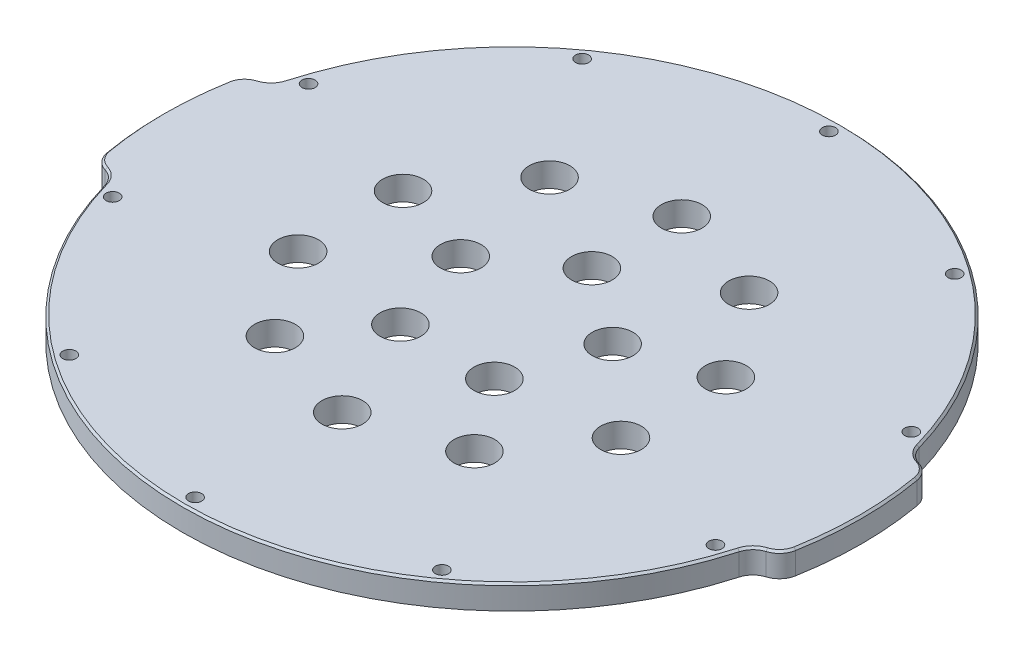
ISO-10303-21;
HEADER;
FILE_DESCRIPTION(('STEP AP214'),'2;1');
FILE_NAME('part.step','',(''),(''),'','','');
FILE_SCHEMA(('AUTOMOTIVE_DESIGN { 1 0 10303 214 1 1 1 1 }'));
ENDSEC;
DATA;
#1=APPLICATION_CONTEXT('core data for automotive mechanical design processes');
#2=APPLICATION_PROTOCOL_DEFINITION('international standard','automotive_design',2000,#1);
#3=PRODUCT_CONTEXT('',#1,'mechanical');
#4=PRODUCT('Part','Part','',(#3));
#5=PRODUCT_RELATED_PRODUCT_CATEGORY('part','',(#4));
#6=PRODUCT_DEFINITION_FORMATION('','',#4);
#7=PRODUCT_DEFINITION_CONTEXT('part definition',#1,'design');
#8=PRODUCT_DEFINITION('design','',#6,#7);
#9=PRODUCT_DEFINITION_SHAPE('','',#8);
#10=(LENGTH_UNIT() NAMED_UNIT(*) SI_UNIT(.MILLI.,.METRE.));
#11=(NAMED_UNIT(*) PLANE_ANGLE_UNIT() SI_UNIT($,.RADIAN.));
#12=(NAMED_UNIT(*) SI_UNIT($,.STERADIAN.) SOLID_ANGLE_UNIT());
#13=UNCERTAINTY_MEASURE_WITH_UNIT(LENGTH_MEASURE(1.E-05),#10,'distance_accuracy_value','');
#14=(GEOMETRIC_REPRESENTATION_CONTEXT(3) GLOBAL_UNCERTAINTY_ASSIGNED_CONTEXT((#13)) GLOBAL_UNIT_ASSIGNED_CONTEXT((#10,
#11,#12)) REPRESENTATION_CONTEXT('',''));
#15=CARTESIAN_POINT('',(0.,0.,0.));
#16=DIRECTION('',(0.,0.,1.));
#17=DIRECTION('',(1.,0.,0.));
#18=AXIS2_PLACEMENT_3D('',#15,#16,#17);
#19=CARTESIAN_POINT('',(-40.6479400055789,6.,-7.16732853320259));
#20=DIRECTION('',(0.,-1.,0.));
#21=DIRECTION('',(0.,0.,-1.));
#22=AXIS2_PLACEMENT_3D('',#19,#20,#21);
#23=PLANE('',#22);
#24=CARTESIAN_POINT('',(84.2258492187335,6.,-23.8957909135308));
#25=DIRECTION('',(0.,-1.,0.));
#26=DIRECTION('',(0.,0.,-1.));
#27=AXIS2_PLACEMENT_3D('',#24,#25,#26);
#28=CIRCLE('',#27,5.50000000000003);
#29=CARTESIAN_POINT('',(82.6143661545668,6.,-18.6371672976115));
#30=VERTEX_POINT('',#29);
#31=CARTESIAN_POINT('',(78.9346765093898,6.,-22.3946275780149));
#32=VERTEX_POINT('',#31);
#33=EDGE_CURVE('E295',#30,#32,#28,.T.);
#34=ORIENTED_EDGE('',*,*,#33,.T.);
#35=CARTESIAN_POINT('',(0.,6.,0.));
#36=DIRECTION('',(0.,-1.,0.));
#37=DIRECTION('',(0.,0.,-1.));
#38=AXIS2_PLACEMENT_3D('',#35,#36,#37);
#39=CIRCLE('',#38,82.05);
#40=CARTESIAN_POINT('',(-78.9346765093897,6.,-22.3946275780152));
#41=VERTEX_POINT('',#40);
#42=EDGE_CURVE('E301',#32,#41,#39,.F.);
#43=ORIENTED_EDGE('',*,*,#42,.T.);
#44=CARTESIAN_POINT('',(-84.2258492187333,6.,-23.8957909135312));
#45=DIRECTION('',(0.,-1.,0.));
#46=DIRECTION('',(0.,0.,-1.));
#47=AXIS2_PLACEMENT_3D('',#44,#45,#46);
#48=CIRCLE('',#47,5.50000000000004);
#49=CARTESIAN_POINT('',(-82.6143661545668,6.,-18.6371672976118));
#50=VERTEX_POINT('',#49);
#51=EDGE_CURVE('E298',#41,#50,#48,.T.);
#52=ORIENTED_EDGE('',*,*,#51,.T.);
#53=CARTESIAN_POINT('',(-81.2958800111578,6.,-14.3346570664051));
#54=DIRECTION('',(0.,-1.,0.));
#55=DIRECTION('',(0.,0.,-1.));
#56=AXIS2_PLACEMENT_3D('',#53,#54,#55);
#57=CIRCLE('',#56,4.49999999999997);
#58=CARTESIAN_POINT('',(-85.7275148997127,6.,-15.1160738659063));
#59=VERTEX_POINT('',#58);
#60=EDGE_CURVE('E292',#50,#59,#57,.F.);
#61=ORIENTED_EDGE('',*,*,#60,.T.);
#62=CARTESIAN_POINT('',(0.,6.,0.));
#63=DIRECTION('',(0.,-1.,0.));
#64=DIRECTION('',(0.,0.,-1.));
#65=AXIS2_PLACEMENT_3D('',#62,#63,#64);
#66=CIRCLE('',#65,87.05);
#67=CARTESIAN_POINT('',(-85.7275148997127,6.,15.1160738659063));
#68=VERTEX_POINT('',#67);
#69=EDGE_CURVE('E286',#59,#68,#66,.F.);
#70=ORIENTED_EDGE('',*,*,#69,.T.);
#71=CARTESIAN_POINT('',(-81.2958800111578,6.,14.3346570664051));
#72=DIRECTION('',(0.,-1.,0.));
#73=DIRECTION('',(0.,0.,-1.));
#74=AXIS2_PLACEMENT_3D('',#71,#72,#73);
#75=CIRCLE('',#74,4.49999999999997);
#76=CARTESIAN_POINT('',(-82.6143661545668,6.,18.6371672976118));
#77=VERTEX_POINT('',#76);
#78=EDGE_CURVE('E280',#68,#77,#75,.F.);
#79=ORIENTED_EDGE('',*,*,#78,.T.);
#80=CARTESIAN_POINT('',(-84.2258492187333,6.,23.8957909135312));
#81=DIRECTION('',(0.,-1.,0.));
#82=DIRECTION('',(0.,0.,-1.));
#83=AXIS2_PLACEMENT_3D('',#80,#81,#82);
#84=CIRCLE('',#83,5.50000000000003);
#85=CARTESIAN_POINT('',(-78.9346765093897,6.,22.3946275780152));
#86=VERTEX_POINT('',#85);
#87=EDGE_CURVE('E274',#77,#86,#84,.T.);
#88=ORIENTED_EDGE('',*,*,#87,.T.);
#89=CARTESIAN_POINT('',(0.,6.,-4.92661467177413E-13));
#90=DIRECTION('',(0.,-1.,0.));
#91=DIRECTION('',(0.,0.,-1.));
#92=AXIS2_PLACEMENT_3D('',#89,#90,#91);
#93=CIRCLE('',#92,82.0500000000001);
#94=CARTESIAN_POINT('',(78.9346765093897,6.,22.3946275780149));
#95=VERTEX_POINT('',#94);
#96=EDGE_CURVE('E268',#86,#95,#93,.F.);
#97=ORIENTED_EDGE('',*,*,#96,.T.);
#98=CARTESIAN_POINT('',(84.2258492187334,6.,23.8957909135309));
#99=DIRECTION('',(0.,-1.,0.));
#100=DIRECTION('',(0.,0.,-1.));
#101=AXIS2_PLACEMENT_3D('',#98,#99,#100);
#102=CIRCLE('',#101,5.50000000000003);
#103=CARTESIAN_POINT('',(82.6143661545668,6.,18.6371672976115));
#104=VERTEX_POINT('',#103);
#105=EDGE_CURVE('E271',#95,#104,#102,.T.);
#106=ORIENTED_EDGE('',*,*,#105,.T.);
#107=CARTESIAN_POINT('',(81.2958800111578,6.,14.3346570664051));
#108=DIRECTION('',(0.,-1.,0.));
#109=DIRECTION('',(0.,0.,-1.));
#110=AXIS2_PLACEMENT_3D('',#107,#108,#109);
#111=CIRCLE('',#110,4.49999999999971);
#112=CARTESIAN_POINT('',(85.7275148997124,6.,15.1160738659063));
#113=VERTEX_POINT('',#112);
#114=EDGE_CURVE('E277',#104,#113,#111,.F.);
#115=ORIENTED_EDGE('',*,*,#114,.T.);
#116=CARTESIAN_POINT('',(-1.29063426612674E-12,6.,0.));
#117=DIRECTION('',(0.,-1.,0.));
#118=DIRECTION('',(0.,0.,-1.));
#119=AXIS2_PLACEMENT_3D('',#116,#117,#118);
#120=CIRCLE('',#119,87.050000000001);
#121=CARTESIAN_POINT('',(85.7275148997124,6.,-15.1160738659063));
#122=VERTEX_POINT('',#121);
#123=EDGE_CURVE('E283',#113,#122,#120,.F.);
#124=ORIENTED_EDGE('',*,*,#123,.T.);
#125=CARTESIAN_POINT('',(81.2958800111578,6.,-14.3346570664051));
#126=DIRECTION('',(0.,-1.,0.));
#127=DIRECTION('',(0.,0.,-1.));
#128=AXIS2_PLACEMENT_3D('',#125,#126,#127);
#129=CIRCLE('',#128,4.49999999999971);
#130=EDGE_CURVE('E289',#122,#30,#129,.F.);
#131=ORIENTED_EDGE('',*,*,#130,.T.);
#132=EDGE_LOOP('',(#34,#43,#52,#61,#70,#79,#88,#97,#106,#115,#124,#131));
#133=FACE_BOUND('',#132,.T.);
#134=CARTESIAN_POINT('',(19.0211303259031,6.,-6.18033988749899));
#135=DIRECTION('',(0.,1.,0.));
#136=DIRECTION('',(0.,0.,1.));
#137=AXIS2_PLACEMENT_3D('',#134,#135,#136);
#138=CIRCLE('',#137,5.1);
#139=CARTESIAN_POINT('',(19.0211303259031,6.,-1.08033988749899));
#140=VERTEX_POINT('',#139);
#141=EDGE_CURVE('E383',#140,#140,#138,.T.);
#142=ORIENTED_EDGE('',*,*,#141,.F.);
#143=EDGE_LOOP('',(#142));
#144=FACE_BOUND('',#143,.T.);
#145=CARTESIAN_POINT('',(0.,6.,-20.));
#146=DIRECTION('',(0.,1.,0.));
#147=DIRECTION('',(0.,0.,1.));
#148=AXIS2_PLACEMENT_3D('',#145,#146,#147);
#149=CIRCLE('',#148,5.1);
#150=CARTESIAN_POINT('',(0.,6.,-14.9));
#151=VERTEX_POINT('',#150);
#152=EDGE_CURVE('E396',#151,#151,#149,.T.);
#153=ORIENTED_EDGE('',*,*,#152,.F.);
#154=EDGE_LOOP('',(#153));
#155=FACE_BOUND('',#154,.T.);
#156=CARTESIAN_POINT('',(-19.0211303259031,6.,-6.1803398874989));
#157=DIRECTION('',(0.,1.,0.));
#158=DIRECTION('',(0.,0.,1.));
#159=AXIS2_PLACEMENT_3D('',#156,#157,#158);
#160=CIRCLE('',#159,5.1);
#161=CARTESIAN_POINT('',(-19.0211303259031,6.,-1.08033988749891));
#162=VERTEX_POINT('',#161);
#163=EDGE_CURVE('E403',#162,#162,#160,.T.);
#164=ORIENTED_EDGE('',*,*,#163,.F.);
#165=EDGE_LOOP('',(#164));
#166=FACE_BOUND('',#165,.T.);
#167=CARTESIAN_POINT('',(-11.7557050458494,6.,16.180339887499));
#168=DIRECTION('',(0.,1.,0.));
#169=DIRECTION('',(0.,0.,1.));
#170=AXIS2_PLACEMENT_3D('',#167,#168,#169);
#171=CIRCLE('',#170,5.1);
#172=CARTESIAN_POINT('',(-11.7557050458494,6.,21.280339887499));
#173=VERTEX_POINT('',#172);
#174=EDGE_CURVE('E410',#173,#173,#171,.T.);
#175=ORIENTED_EDGE('',*,*,#174,.F.);
#176=EDGE_LOOP('',(#175));
#177=FACE_BOUND('',#176,.T.);
#178=CARTESIAN_POINT('',(-24.9808732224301,6.,-34.3832222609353));
#179=DIRECTION('',(0.,1.,0.));
#180=DIRECTION('',(0.,0.,1.));
#181=AXIS2_PLACEMENT_3D('',#178,#179,#180);
#182=CIRCLE('',#181,5.1);
#183=CARTESIAN_POINT('',(-24.9808732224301,6.,-29.2832222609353));
#184=VERTEX_POINT('',#183);
#185=EDGE_CURVE('E418',#184,#184,#182,.T.);
#186=ORIENTED_EDGE('',*,*,#185,.F.);
#187=EDGE_LOOP('',(#186));
#188=FACE_BOUND('',#187,.T.);
#189=CARTESIAN_POINT('',(-40.419901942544,6.,-13.1332222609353));
#190=DIRECTION('',(0.,1.,0.));
#191=DIRECTION('',(0.,0.,1.));
#192=AXIS2_PLACEMENT_3D('',#189,#190,#191);
#193=CIRCLE('',#192,5.1);
#194=CARTESIAN_POINT('',(-40.419901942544,6.,-8.03322226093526));
#195=VERTEX_POINT('',#194);
#196=EDGE_CURVE('E426',#195,#195,#193,.T.);
#197=ORIENTED_EDGE('',*,*,#196,.F.);
#198=EDGE_LOOP('',(#197));
#199=FACE_BOUND('',#198,.T.);
#200=CARTESIAN_POINT('',(-40.419901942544,6.,13.1332222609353));
#201=DIRECTION('',(0.,1.,0.));
#202=DIRECTION('',(0.,0.,1.));
#203=AXIS2_PLACEMENT_3D('',#200,#201,#202);
#204=CIRCLE('',#203,5.09999999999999);
#205=CARTESIAN_POINT('',(-40.419901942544,6.,18.2332222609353));
#206=VERTEX_POINT('',#205);
#207=EDGE_CURVE('E434',#206,#206,#204,.T.);
#208=ORIENTED_EDGE('',*,*,#207,.F.);
#209=EDGE_LOOP('',(#208));
#210=FACE_BOUND('',#209,.T.);
#211=CARTESIAN_POINT('',(-24.9808732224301,6.,34.3832222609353));
#212=DIRECTION('',(0.,1.,0.));
#213=DIRECTION('',(0.,0.,1.));
#214=AXIS2_PLACEMENT_3D('',#211,#212,#213);
#215=CIRCLE('',#214,5.1);
#216=CARTESIAN_POINT('',(-24.9808732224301,6.,39.4832222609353));
#217=VERTEX_POINT('',#216);
#218=EDGE_CURVE('E442',#217,#217,#215,.T.);
#219=ORIENTED_EDGE('',*,*,#218,.F.);
#220=EDGE_LOOP('',(#219));
#221=FACE_BOUND('',#220,.T.);
#222=CARTESIAN_POINT('',(0.,6.,42.5));
#223=DIRECTION('',(0.,1.,0.));
#224=DIRECTION('',(0.,0.,1.));
#225=AXIS2_PLACEMENT_3D('',#222,#223,#224);
#226=CIRCLE('',#225,5.1);
#227=CARTESIAN_POINT('',(0.,6.,47.6));
#228=VERTEX_POINT('',#227);
#229=EDGE_CURVE('E450',#228,#228,#226,.T.);
#230=ORIENTED_EDGE('',*,*,#229,.F.);
#231=EDGE_LOOP('',(#230));
#232=FACE_BOUND('',#231,.T.);
#233=CARTESIAN_POINT('',(11.7557050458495,6.,16.1803398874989));
#234=DIRECTION('',(0.,1.,0.));
#235=DIRECTION('',(0.,0.,1.));
#236=AXIS2_PLACEMENT_3D('',#233,#234,#235);
#237=CIRCLE('',#236,5.1);
#238=CARTESIAN_POINT('',(11.7557050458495,6.,21.2803398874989));
#239=VERTEX_POINT('',#238);
#240=EDGE_CURVE('E458',#239,#239,#237,.T.);
#241=ORIENTED_EDGE('',*,*,#240,.F.);
#242=EDGE_LOOP('',(#241));
#243=FACE_BOUND('',#242,.T.);
#244=CARTESIAN_POINT('',(24.9808732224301,6.,34.3832222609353));
#245=DIRECTION('',(0.,1.,0.));
#246=DIRECTION('',(0.,0.,1.));
#247=AXIS2_PLACEMENT_3D('',#244,#245,#246);
#248=CIRCLE('',#247,5.1);
#249=CARTESIAN_POINT('',(24.9808732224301,6.,39.4832222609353));
#250=VERTEX_POINT('',#249);
#251=EDGE_CURVE('E466',#250,#250,#248,.T.);
#252=ORIENTED_EDGE('',*,*,#251,.F.);
#253=EDGE_LOOP('',(#252));
#254=FACE_BOUND('',#253,.T.);
#255=CARTESIAN_POINT('',(40.419901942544,6.,13.1332222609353));
#256=DIRECTION('',(0.,1.,0.));
#257=DIRECTION('',(0.,0.,1.));
#258=AXIS2_PLACEMENT_3D('',#255,#256,#257);
#259=CIRCLE('',#258,5.10000000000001);
#260=CARTESIAN_POINT('',(40.419901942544,6.,18.2332222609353));
#261=VERTEX_POINT('',#260);
#262=EDGE_CURVE('E474',#261,#261,#259,.T.);
#263=ORIENTED_EDGE('',*,*,#262,.F.);
#264=EDGE_LOOP('',(#263));
#265=FACE_BOUND('',#264,.T.);
#266=CARTESIAN_POINT('',(40.419901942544,6.,-13.1332222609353));
#267=DIRECTION('',(0.,1.,0.));
#268=DIRECTION('',(0.,0.,1.));
#269=AXIS2_PLACEMENT_3D('',#266,#267,#268);
#270=CIRCLE('',#269,5.1);
#271=CARTESIAN_POINT('',(40.419901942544,6.,-8.03322226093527));
#272=VERTEX_POINT('',#271);
#273=EDGE_CURVE('E482',#272,#272,#270,.T.);
#274=ORIENTED_EDGE('',*,*,#273,.F.);
#275=EDGE_LOOP('',(#274));
#276=FACE_BOUND('',#275,.T.);
#277=CARTESIAN_POINT('',(24.9808732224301,6.,-34.3832222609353));
#278=DIRECTION('',(0.,1.,0.));
#279=DIRECTION('',(0.,0.,1.));
#280=AXIS2_PLACEMENT_3D('',#277,#278,#279);
#281=CIRCLE('',#280,5.1);
#282=CARTESIAN_POINT('',(24.9808732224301,6.,-29.2832222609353));
#283=VERTEX_POINT('',#282);
#284=EDGE_CURVE('E490',#283,#283,#281,.T.);
#285=ORIENTED_EDGE('',*,*,#284,.F.);
#286=EDGE_LOOP('',(#285));
#287=FACE_BOUND('',#286,.T.);
#288=CARTESIAN_POINT('',(0.,6.,-42.5));
#289=DIRECTION('',(0.,1.,0.));
#290=DIRECTION('',(0.,0.,1.));
#291=AXIS2_PLACEMENT_3D('',#288,#289,#290);
#292=CIRCLE('',#291,5.1);
#293=CARTESIAN_POINT('',(0.,6.,-37.4));
#294=VERTEX_POINT('',#293);
#295=EDGE_CURVE('E498',#294,#294,#292,.T.);
#296=ORIENTED_EDGE('',*,*,#295,.F.);
#297=EDGE_LOOP('',(#296));
#298=FACE_BOUND('',#297,.T.);
#299=CARTESIAN_POINT('',(-75.4663345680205,6.,-24.5204985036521));
#300=DIRECTION('',(0.,1.,0.));
#301=DIRECTION('',(0.,0.,1.));
#302=AXIS2_PLACEMENT_3D('',#299,#300,#301);
#303=CIRCLE('',#302,1.6500000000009);
#304=CARTESIAN_POINT('',(-75.4663345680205,6.,-22.8704985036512));
#305=VERTEX_POINT('',#304);
#306=EDGE_CURVE('E518',#305,#305,#303,.T.);
#307=ORIENTED_EDGE('',*,*,#306,.F.);
#308=EDGE_LOOP('',(#307));
#309=FACE_BOUND('',#308,.T.);
#310=CARTESIAN_POINT('',(-46.6407597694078,6.,64.1954985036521));
#311=DIRECTION('',(0.,1.,0.));
#312=DIRECTION('',(0.,0.,1.));
#313=AXIS2_PLACEMENT_3D('',#310,#311,#312);
#314=CIRCLE('',#313,1.65000000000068);
#315=CARTESIAN_POINT('',(-46.6407597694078,6.,65.8454985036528));
#316=VERTEX_POINT('',#315);
#317=EDGE_CURVE('E534',#316,#316,#314,.T.);
#318=ORIENTED_EDGE('',*,*,#317,.F.);
#319=EDGE_LOOP('',(#318));
#320=FACE_BOUND('',#319,.T.);
#321=CARTESIAN_POINT('',(46.6407597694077,6.,64.1954985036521));
#322=DIRECTION('',(0.,1.,0.));
#323=DIRECTION('',(0.,0.,1.));
#324=AXIS2_PLACEMENT_3D('',#321,#322,#323);
#325=CIRCLE('',#324,1.65000000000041);
#326=CARTESIAN_POINT('',(46.6407597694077,6.,65.8454985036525));
#327=VERTEX_POINT('',#326);
#328=EDGE_CURVE('E550',#327,#327,#325,.T.);
#329=ORIENTED_EDGE('',*,*,#328,.F.);
#330=EDGE_LOOP('',(#329));
#331=FACE_BOUND('',#330,.T.);
#332=CARTESIAN_POINT('',(75.4663345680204,6.,-24.5204985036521));
#333=DIRECTION('',(0.,1.,0.));
#334=DIRECTION('',(0.,0.,1.));
#335=AXIS2_PLACEMENT_3D('',#332,#333,#334);
#336=CIRCLE('',#335,1.65000000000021);
#337=CARTESIAN_POINT('',(75.4663345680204,6.,-22.8704985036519));
#338=VERTEX_POINT('',#337);
#339=EDGE_CURVE('E566',#338,#338,#336,.T.);
#340=ORIENTED_EDGE('',*,*,#339,.F.);
#341=EDGE_LOOP('',(#340));
#342=FACE_BOUND('',#341,.T.);
#343=CARTESIAN_POINT('',(0.,6.,-79.35));
#344=DIRECTION('',(0.,1.,0.));
#345=DIRECTION('',(0.,0.,1.));
#346=AXIS2_PLACEMENT_3D('',#343,#344,#345);
#347=CIRCLE('',#346,1.65);
#348=CARTESIAN_POINT('',(0.,6.,-77.7));
#349=VERTEX_POINT('',#348);
#350=EDGE_CURVE('E191',#349,#349,#347,.T.);
#351=ORIENTED_EDGE('',*,*,#350,.F.);
#352=EDGE_LOOP('',(#351));
#353=FACE_BOUND('',#352,.T.);
#354=CARTESIAN_POINT('',(46.6407597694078,6.,-64.1954985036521));
#355=DIRECTION('',(0.,1.,0.));
#356=DIRECTION('',(0.,0.,1.));
#357=AXIS2_PLACEMENT_3D('',#354,#355,#356);
#358=CIRCLE('',#357,1.65000000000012);
#359=CARTESIAN_POINT('',(46.6407597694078,6.,-62.5454985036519));
#360=VERTEX_POINT('',#359);
#361=EDGE_CURVE('E574',#360,#360,#358,.T.);
#362=ORIENTED_EDGE('',*,*,#361,.F.);
#363=EDGE_LOOP('',(#362));
#364=FACE_BOUND('',#363,.T.);
#365=CARTESIAN_POINT('',(75.4663345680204,6.,24.5204985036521));
#366=DIRECTION('',(0.,1.,0.));
#367=DIRECTION('',(0.,0.,1.));
#368=AXIS2_PLACEMENT_3D('',#365,#366,#367);
#369=CIRCLE('',#368,1.65000000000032);
#370=CARTESIAN_POINT('',(75.4663345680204,6.,26.1704985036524));
#371=VERTEX_POINT('',#370);
#372=EDGE_CURVE('E558',#371,#371,#369,.T.);
#373=ORIENTED_EDGE('',*,*,#372,.F.);
#374=EDGE_LOOP('',(#373));
#375=FACE_BOUND('',#374,.T.);
#376=CARTESIAN_POINT('',(0.,6.,79.35));
#377=DIRECTION('',(0.,1.,0.));
#378=DIRECTION('',(0.,0.,1.));
#379=AXIS2_PLACEMENT_3D('',#376,#377,#378);
#380=CIRCLE('',#379,1.65000000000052);
#381=CARTESIAN_POINT('',(0.,6.,81.0000000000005));
#382=VERTEX_POINT('',#381);
#383=EDGE_CURVE('E542',#382,#382,#380,.T.);
#384=ORIENTED_EDGE('',*,*,#383,.F.);
#385=EDGE_LOOP('',(#384));
#386=FACE_BOUND('',#385,.T.);
#387=CARTESIAN_POINT('',(-75.4663345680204,6.,24.5204985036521));
#388=DIRECTION('',(0.,1.,0.));
#389=DIRECTION('',(0.,0.,1.));
#390=AXIS2_PLACEMENT_3D('',#387,#388,#389);
#391=CIRCLE('',#390,1.65000000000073);
#392=CARTESIAN_POINT('',(-75.4663345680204,6.,26.1704985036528));
#393=VERTEX_POINT('',#392);
#394=EDGE_CURVE('E526',#393,#393,#391,.T.);
#395=ORIENTED_EDGE('',*,*,#394,.F.);
#396=EDGE_LOOP('',(#395));
#397=FACE_BOUND('',#396,.T.);
#398=CARTESIAN_POINT('',(-46.6407597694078,6.,-64.1954985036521));
#399=DIRECTION('',(0.,1.,0.));
#400=DIRECTION('',(0.,0.,1.));
#401=AXIS2_PLACEMENT_3D('',#398,#399,#400);
#402=CIRCLE('',#401,1.65000000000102);
#403=CARTESIAN_POINT('',(-46.6407597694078,6.,-62.545498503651));
#404=VERTEX_POINT('',#403);
#405=EDGE_CURVE('E510',#404,#404,#402,.T.);
#406=ORIENTED_EDGE('',*,*,#405,.F.);
#407=EDGE_LOOP('',(#406));
#408=FACE_BOUND('',#407,.T.);
#409=ADVANCED_FACE('F41',(#133,#144,#155,#166,#177,#188,#199,#210,#221,#232,#243,#254,#265,#276,
#287,#298,#309,#320,#331,#342,#353,#364,#375,#386,#397,#408),#23,.F.);
#410=CARTESIAN_POINT('',(-40.6479400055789,0.,-7.16732853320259));
#411=DIRECTION('',(0.,-1.,0.));
#412=DIRECTION('',(0.,0.,-1.));
#413=AXIS2_PLACEMENT_3D('',#410,#411,#412);
#414=PLANE('',#413);
#415=CARTESIAN_POINT('',(19.0211303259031,0.,-6.18033988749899));
#416=DIRECTION('',(0.,1.,0.));
#417=DIRECTION('',(0.,0.,1.));
#418=AXIS2_PLACEMENT_3D('',#415,#416,#417);
#419=CIRCLE('',#418,5.1);
#420=CARTESIAN_POINT('',(19.0211303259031,0.,-1.08033988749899));
#421=VERTEX_POINT('',#420);
#422=EDGE_CURVE('E389',#421,#421,#419,.T.);
#423=ORIENTED_EDGE('',*,*,#422,.T.);
#424=EDGE_LOOP('',(#423));
#425=FACE_BOUND('',#424,.T.);
#426=CARTESIAN_POINT('',(0.,0.,-20.));
#427=DIRECTION('',(0.,1.,0.));
#428=DIRECTION('',(0.,0.,1.));
#429=AXIS2_PLACEMENT_3D('',#426,#427,#428);
#430=CIRCLE('',#429,5.1);
#431=CARTESIAN_POINT('',(0.,0.,-14.9));
#432=VERTEX_POINT('',#431);
#433=EDGE_CURVE('E399',#432,#432,#430,.T.);
#434=ORIENTED_EDGE('',*,*,#433,.T.);
#435=EDGE_LOOP('',(#434));
#436=FACE_BOUND('',#435,.T.);
#437=CARTESIAN_POINT('',(-19.0211303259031,0.,-6.1803398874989));
#438=DIRECTION('',(0.,1.,0.));
#439=DIRECTION('',(0.,0.,1.));
#440=AXIS2_PLACEMENT_3D('',#437,#438,#439);
#441=CIRCLE('',#440,5.1);
#442=CARTESIAN_POINT('',(-19.0211303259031,0.,-1.08033988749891));
#443=VERTEX_POINT('',#442);
#444=EDGE_CURVE('E407',#443,#443,#441,.T.);
#445=ORIENTED_EDGE('',*,*,#444,.T.);
#446=EDGE_LOOP('',(#445));
#447=FACE_BOUND('',#446,.T.);
#448=CARTESIAN_POINT('',(-11.7557050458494,0.,16.180339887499));
#449=DIRECTION('',(0.,1.,0.));
#450=DIRECTION('',(0.,0.,1.));
#451=AXIS2_PLACEMENT_3D('',#448,#449,#450);
#452=CIRCLE('',#451,5.1);
#453=CARTESIAN_POINT('',(-11.7557050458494,0.,21.280339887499));
#454=VERTEX_POINT('',#453);
#455=EDGE_CURVE('E414',#454,#454,#452,.T.);
#456=ORIENTED_EDGE('',*,*,#455,.T.);
#457=EDGE_LOOP('',(#456));
#458=FACE_BOUND('',#457,.T.);
#459=CARTESIAN_POINT('',(-24.9808732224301,0.,-34.3832222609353));
#460=DIRECTION('',(0.,1.,0.));
#461=DIRECTION('',(0.,0.,1.));
#462=AXIS2_PLACEMENT_3D('',#459,#460,#461);
#463=CIRCLE('',#462,5.1);
#464=CARTESIAN_POINT('',(-24.9808732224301,0.,-29.2832222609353));
#465=VERTEX_POINT('',#464);
#466=EDGE_CURVE('E422',#465,#465,#463,.T.);
#467=ORIENTED_EDGE('',*,*,#466,.T.);
#468=EDGE_LOOP('',(#467));
#469=FACE_BOUND('',#468,.T.);
#470=CARTESIAN_POINT('',(-40.419901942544,0.,-13.1332222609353));
#471=DIRECTION('',(0.,1.,0.));
#472=DIRECTION('',(0.,0.,1.));
#473=AXIS2_PLACEMENT_3D('',#470,#471,#472);
#474=CIRCLE('',#473,5.1);
#475=CARTESIAN_POINT('',(-40.419901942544,0.,-8.03322226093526));
#476=VERTEX_POINT('',#475);
#477=EDGE_CURVE('E430',#476,#476,#474,.T.);
#478=ORIENTED_EDGE('',*,*,#477,.T.);
#479=EDGE_LOOP('',(#478));
#480=FACE_BOUND('',#479,.T.);
#481=CARTESIAN_POINT('',(-40.419901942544,0.,13.1332222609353));
#482=DIRECTION('',(0.,1.,0.));
#483=DIRECTION('',(0.,0.,1.));
#484=AXIS2_PLACEMENT_3D('',#481,#482,#483);
#485=CIRCLE('',#484,5.09999999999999);
#486=CARTESIAN_POINT('',(-40.419901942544,0.,18.2332222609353));
#487=VERTEX_POINT('',#486);
#488=EDGE_CURVE('E438',#487,#487,#485,.T.);
#489=ORIENTED_EDGE('',*,*,#488,.T.);
#490=EDGE_LOOP('',(#489));
#491=FACE_BOUND('',#490,.T.);
#492=CARTESIAN_POINT('',(-24.9808732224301,0.,34.3832222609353));
#493=DIRECTION('',(0.,1.,0.));
#494=DIRECTION('',(0.,0.,1.));
#495=AXIS2_PLACEMENT_3D('',#492,#493,#494);
#496=CIRCLE('',#495,5.1);
#497=CARTESIAN_POINT('',(-24.9808732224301,0.,39.4832222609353));
#498=VERTEX_POINT('',#497);
#499=EDGE_CURVE('E446',#498,#498,#496,.T.);
#500=ORIENTED_EDGE('',*,*,#499,.T.);
#501=EDGE_LOOP('',(#500));
#502=FACE_BOUND('',#501,.T.);
#503=CARTESIAN_POINT('',(0.,0.,42.5));
#504=DIRECTION('',(0.,1.,0.));
#505=DIRECTION('',(0.,0.,1.));
#506=AXIS2_PLACEMENT_3D('',#503,#504,#505);
#507=CIRCLE('',#506,5.1);
#508=CARTESIAN_POINT('',(0.,0.,47.6));
#509=VERTEX_POINT('',#508);
#510=EDGE_CURVE('E454',#509,#509,#507,.T.);
#511=ORIENTED_EDGE('',*,*,#510,.T.);
#512=EDGE_LOOP('',(#511));
#513=FACE_BOUND('',#512,.T.);
#514=CARTESIAN_POINT('',(11.7557050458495,0.,16.1803398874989));
#515=DIRECTION('',(0.,1.,0.));
#516=DIRECTION('',(0.,0.,1.));
#517=AXIS2_PLACEMENT_3D('',#514,#515,#516);
#518=CIRCLE('',#517,5.1);
#519=CARTESIAN_POINT('',(11.7557050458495,0.,21.2803398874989));
#520=VERTEX_POINT('',#519);
#521=EDGE_CURVE('E462',#520,#520,#518,.T.);
#522=ORIENTED_EDGE('',*,*,#521,.T.);
#523=EDGE_LOOP('',(#522));
#524=FACE_BOUND('',#523,.T.);
#525=CARTESIAN_POINT('',(24.9808732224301,0.,34.3832222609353));
#526=DIRECTION('',(0.,1.,0.));
#527=DIRECTION('',(0.,0.,1.));
#528=AXIS2_PLACEMENT_3D('',#525,#526,#527);
#529=CIRCLE('',#528,5.1);
#530=CARTESIAN_POINT('',(24.9808732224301,0.,39.4832222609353));
#531=VERTEX_POINT('',#530);
#532=EDGE_CURVE('E470',#531,#531,#529,.T.);
#533=ORIENTED_EDGE('',*,*,#532,.T.);
#534=EDGE_LOOP('',(#533));
#535=FACE_BOUND('',#534,.T.);
#536=CARTESIAN_POINT('',(40.419901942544,0.,13.1332222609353));
#537=DIRECTION('',(0.,1.,0.));
#538=DIRECTION('',(0.,0.,1.));
#539=AXIS2_PLACEMENT_3D('',#536,#537,#538);
#540=CIRCLE('',#539,5.10000000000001);
#541=CARTESIAN_POINT('',(40.419901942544,0.,18.2332222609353));
#542=VERTEX_POINT('',#541);
#543=EDGE_CURVE('E478',#542,#542,#540,.T.);
#544=ORIENTED_EDGE('',*,*,#543,.T.);
#545=EDGE_LOOP('',(#544));
#546=FACE_BOUND('',#545,.T.);
#547=CARTESIAN_POINT('',(40.419901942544,0.,-13.1332222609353));
#548=DIRECTION('',(0.,1.,0.));
#549=DIRECTION('',(0.,0.,1.));
#550=AXIS2_PLACEMENT_3D('',#547,#548,#549);
#551=CIRCLE('',#550,5.1);
#552=CARTESIAN_POINT('',(40.419901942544,0.,-8.03322226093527));
#553=VERTEX_POINT('',#552);
#554=EDGE_CURVE('E486',#553,#553,#551,.T.);
#555=ORIENTED_EDGE('',*,*,#554,.T.);
#556=EDGE_LOOP('',(#555));
#557=FACE_BOUND('',#556,.T.);
#558=CARTESIAN_POINT('',(24.9808732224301,0.,-34.3832222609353));
#559=DIRECTION('',(0.,1.,0.));
#560=DIRECTION('',(0.,0.,1.));
#561=AXIS2_PLACEMENT_3D('',#558,#559,#560);
#562=CIRCLE('',#561,5.1);
#563=CARTESIAN_POINT('',(24.9808732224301,0.,-29.2832222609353));
#564=VERTEX_POINT('',#563);
#565=EDGE_CURVE('E494',#564,#564,#562,.T.);
#566=ORIENTED_EDGE('',*,*,#565,.T.);
#567=EDGE_LOOP('',(#566));
#568=FACE_BOUND('',#567,.T.);
#569=CARTESIAN_POINT('',(0.,0.,-42.5));
#570=DIRECTION('',(0.,1.,0.));
#571=DIRECTION('',(0.,0.,1.));
#572=AXIS2_PLACEMENT_3D('',#569,#570,#571);
#573=CIRCLE('',#572,5.1);
#574=CARTESIAN_POINT('',(0.,0.,-37.4));
#575=VERTEX_POINT('',#574);
#576=EDGE_CURVE('E502',#575,#575,#573,.T.);
#577=ORIENTED_EDGE('',*,*,#576,.T.);
#578=EDGE_LOOP('',(#577));
#579=FACE_BOUND('',#578,.T.);
#580=CARTESIAN_POINT('',(-75.4663345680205,0.,-24.5204985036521));
#581=DIRECTION('',(0.,1.,0.));
#582=DIRECTION('',(0.,0.,1.));
#583=AXIS2_PLACEMENT_3D('',#580,#581,#582);
#584=CIRCLE('',#583,1.6500000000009);
#585=CARTESIAN_POINT('',(-75.4663345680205,0.,-22.8704985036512));
#586=VERTEX_POINT('',#585);
#587=EDGE_CURVE('E514',#586,#586,#584,.T.);
#588=ORIENTED_EDGE('',*,*,#587,.T.);
#589=EDGE_LOOP('',(#588));
#590=FACE_BOUND('',#589,.T.);
#591=CARTESIAN_POINT('',(-46.6407597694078,0.,64.1954985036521));
#592=DIRECTION('',(0.,1.,0.));
#593=DIRECTION('',(0.,0.,1.));
#594=AXIS2_PLACEMENT_3D('',#591,#592,#593);
#595=CIRCLE('',#594,1.65000000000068);
#596=CARTESIAN_POINT('',(-46.6407597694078,0.,65.8454985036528));
#597=VERTEX_POINT('',#596);
#598=EDGE_CURVE('E530',#597,#597,#595,.T.);
#599=ORIENTED_EDGE('',*,*,#598,.T.);
#600=EDGE_LOOP('',(#599));
#601=FACE_BOUND('',#600,.T.);
#602=CARTESIAN_POINT('',(46.6407597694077,0.,64.1954985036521));
#603=DIRECTION('',(0.,1.,0.));
#604=DIRECTION('',(0.,0.,1.));
#605=AXIS2_PLACEMENT_3D('',#602,#603,#604);
#606=CIRCLE('',#605,1.65000000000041);
#607=CARTESIAN_POINT('',(46.6407597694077,0.,65.8454985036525));
#608=VERTEX_POINT('',#607);
#609=EDGE_CURVE('E546',#608,#608,#606,.T.);
#610=ORIENTED_EDGE('',*,*,#609,.T.);
#611=EDGE_LOOP('',(#610));
#612=FACE_BOUND('',#611,.T.);
#613=CARTESIAN_POINT('',(75.4663345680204,0.,-24.5204985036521));
#614=DIRECTION('',(0.,1.,0.));
#615=DIRECTION('',(0.,0.,1.));
#616=AXIS2_PLACEMENT_3D('',#613,#614,#615);
#617=CIRCLE('',#616,1.65000000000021);
#618=CARTESIAN_POINT('',(75.4663345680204,0.,-22.8704985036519));
#619=VERTEX_POINT('',#618);
#620=EDGE_CURVE('E562',#619,#619,#617,.T.);
#621=ORIENTED_EDGE('',*,*,#620,.T.);
#622=EDGE_LOOP('',(#621));
#623=FACE_BOUND('',#622,.T.);
#624=CARTESIAN_POINT('',(0.,0.,-79.35));
#625=DIRECTION('',(0.,1.,0.));
#626=DIRECTION('',(0.,0.,1.));
#627=AXIS2_PLACEMENT_3D('',#624,#625,#626);
#628=CIRCLE('',#627,1.65);
#629=CARTESIAN_POINT('',(0.,0.,-77.7));
#630=VERTEX_POINT('',#629);
#631=EDGE_CURVE('E578',#630,#630,#628,.T.);
#632=ORIENTED_EDGE('',*,*,#631,.T.);
#633=EDGE_LOOP('',(#632));
#634=FACE_BOUND('',#633,.T.);
#635=CARTESIAN_POINT('',(-81.2958800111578,0.,-14.3346570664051));
#636=DIRECTION('',(0.,1.,0.));
#637=DIRECTION('',(0.,0.,-1.));
#638=AXIS2_PLACEMENT_3D('',#635,#636,#637);
#639=CIRCLE('',#638,5.00000000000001);
#640=CARTESIAN_POINT('',(-82.7608646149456,0.,-19.1152239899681));
#641=VERTEX_POINT('',#640);
#642=CARTESIAN_POINT('',(-86.2199187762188,0.,-15.2028979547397));
#643=VERTEX_POINT('',#642);
#644=EDGE_CURVE('E184',#641,#643,#639,.T.);
#645=ORIENTED_EDGE('',*,*,#644,.F.);
#646=CARTESIAN_POINT('',(-84.2258492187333,0.,-23.8957909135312));
#647=DIRECTION('',(0.,-1.,0.));
#648=DIRECTION('',(0.,0.,-1.));
#649=AXIS2_PLACEMENT_3D('',#646,#647,#648);
#650=CIRCLE('',#649,5.);
#651=CARTESIAN_POINT('',(-79.4156922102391,0.,-22.531096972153));
#652=VERTEX_POINT('',#651);
#653=EDGE_CURVE('E262',#641,#652,#650,.F.);
#654=ORIENTED_EDGE('',*,*,#653,.T.);
#655=CARTESIAN_POINT('',(0.,0.,0.));
#656=DIRECTION('',(0.,1.,0.));
#657=DIRECTION('',(0.,0.,-1.));
#658=AXIS2_PLACEMENT_3D('',#655,#656,#657);
#659=CIRCLE('',#658,82.55);
#660=CARTESIAN_POINT('',(79.4156922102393,0.,-22.5310969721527));
#661=VERTEX_POINT('',#660);
#662=EDGE_CURVE('E221',#661,#652,#659,.T.);
#663=ORIENTED_EDGE('',*,*,#662,.F.);
#664=CARTESIAN_POINT('',(84.2258492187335,0.,-23.8957909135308));
#665=DIRECTION('',(0.,-1.,0.));
#666=DIRECTION('',(0.,0.,-1.));
#667=AXIS2_PLACEMENT_3D('',#664,#665,#666);
#668=CIRCLE('',#667,5.);
#669=CARTESIAN_POINT('',(82.7608646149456,0.,-19.1152239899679));
#670=VERTEX_POINT('',#669);
#671=EDGE_CURVE('E259',#661,#670,#668,.F.);
#672=ORIENTED_EDGE('',*,*,#671,.T.);
#673=CARTESIAN_POINT('',(81.2958800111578,0.,-14.3346570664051));
#674=DIRECTION('',(0.,1.,0.));
#675=DIRECTION('',(0.,0.,1.));
#676=AXIS2_PLACEMENT_3D('',#673,#674,#675);
#677=CIRCLE('',#676,4.99999999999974);
#678=CARTESIAN_POINT('',(86.2199187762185,0.,-15.2028979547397));
#679=VERTEX_POINT('',#678);
#680=EDGE_CURVE('E217',#679,#670,#677,.T.);
#681=ORIENTED_EDGE('',*,*,#680,.F.);
#682=CARTESIAN_POINT('',(-1.29063426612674E-12,0.,0.));
#683=DIRECTION('',(0.,1.,0.));
#684=DIRECTION('',(0.,0.,1.));
#685=AXIS2_PLACEMENT_3D('',#682,#683,#684);
#686=CIRCLE('',#685,87.550000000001);
#687=CARTESIAN_POINT('',(86.2199187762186,0.,15.2028979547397));
#688=VERTEX_POINT('',#687);
#689=EDGE_CURVE('E213',#688,#679,#686,.T.);
#690=ORIENTED_EDGE('',*,*,#689,.F.);
#691=CARTESIAN_POINT('',(81.2958800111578,0.,14.3346570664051));
#692=DIRECTION('',(0.,1.,0.));
#693=DIRECTION('',(0.,0.,-1.));
#694=AXIS2_PLACEMENT_3D('',#691,#692,#693);
#695=CIRCLE('',#694,4.99999999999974);
#696=CARTESIAN_POINT('',(82.7608646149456,0.,19.1152239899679));
#697=VERTEX_POINT('',#696);
#698=EDGE_CURVE('E209',#697,#688,#695,.T.);
#699=ORIENTED_EDGE('',*,*,#698,.F.);
#700=CARTESIAN_POINT('',(84.2258492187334,0.,23.8957909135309));
#701=DIRECTION('',(0.,-1.,0.));
#702=DIRECTION('',(0.,0.,-1.));
#703=AXIS2_PLACEMENT_3D('',#700,#701,#702);
#704=CIRCLE('',#703,5.);
#705=CARTESIAN_POINT('',(79.4156922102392,0.,22.5310969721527));
#706=VERTEX_POINT('',#705);
#707=EDGE_CURVE('E256',#697,#706,#704,.F.);
#708=ORIENTED_EDGE('',*,*,#707,.T.);
#709=CARTESIAN_POINT('',(0.,0.,-4.92661467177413E-13));
#710=DIRECTION('',(0.,1.,0.));
#711=DIRECTION('',(0.,0.,-1.));
#712=AXIS2_PLACEMENT_3D('',#709,#710,#711);
#713=CIRCLE('',#712,82.5500000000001);
#714=CARTESIAN_POINT('',(-79.4156922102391,0.,22.531096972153));
#715=VERTEX_POINT('',#714);
#716=EDGE_CURVE('E202',#715,#706,#713,.T.);
#717=ORIENTED_EDGE('',*,*,#716,.F.);
#718=CARTESIAN_POINT('',(-84.2258492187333,0.,23.8957909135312));
#719=DIRECTION('',(0.,-1.,0.));
#720=DIRECTION('',(0.,0.,-1.));
#721=AXIS2_PLACEMENT_3D('',#718,#719,#720);
#722=CIRCLE('',#721,5.);
#723=CARTESIAN_POINT('',(-82.7608646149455,0.,19.1152239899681));
#724=VERTEX_POINT('',#723);
#725=EDGE_CURVE('E265',#715,#724,#722,.F.);
#726=ORIENTED_EDGE('',*,*,#725,.T.);
#727=CARTESIAN_POINT('',(-81.2958800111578,0.,14.3346570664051));
#728=DIRECTION('',(0.,1.,0.));
#729=DIRECTION('',(0.,0.,1.));
#730=AXIS2_PLACEMENT_3D('',#727,#728,#729);
#731=CIRCLE('',#730,5.00000000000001);
#732=CARTESIAN_POINT('',(-86.2199187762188,0.,15.2028979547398));
#733=VERTEX_POINT('',#732);
#734=EDGE_CURVE('E196',#733,#724,#731,.T.);
#735=ORIENTED_EDGE('',*,*,#734,.F.);
#736=CARTESIAN_POINT('',(0.,0.,0.));
#737=DIRECTION('',(0.,1.,0.));
#738=DIRECTION('',(0.,0.,-1.));
#739=AXIS2_PLACEMENT_3D('',#736,#737,#738);
#740=CIRCLE('',#739,87.55);
#741=EDGE_CURVE('E173',#643,#733,#740,.T.);
#742=ORIENTED_EDGE('',*,*,#741,.F.);
#743=EDGE_LOOP('',(#645,#654,#663,#672,#681,#690,#699,#708,#717,#726,#735,#742));
#744=FACE_BOUND('',#743,.T.);
#745=CARTESIAN_POINT('',(46.6407597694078,0.,-64.1954985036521));
#746=DIRECTION('',(0.,1.,0.));
#747=DIRECTION('',(0.,0.,1.));
#748=AXIS2_PLACEMENT_3D('',#745,#746,#747);
#749=CIRCLE('',#748,1.65000000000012);
#750=CARTESIAN_POINT('',(46.6407597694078,0.,-62.5454985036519));
#751=VERTEX_POINT('',#750);
#752=EDGE_CURVE('E570',#751,#751,#749,.T.);
#753=ORIENTED_EDGE('',*,*,#752,.T.);
#754=EDGE_LOOP('',(#753));
#755=FACE_BOUND('',#754,.T.);
#756=CARTESIAN_POINT('',(75.4663345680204,0.,24.5204985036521));
#757=DIRECTION('',(0.,1.,0.));
#758=DIRECTION('',(0.,0.,1.));
#759=AXIS2_PLACEMENT_3D('',#756,#757,#758);
#760=CIRCLE('',#759,1.65000000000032);
#761=CARTESIAN_POINT('',(75.4663345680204,0.,26.1704985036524));
#762=VERTEX_POINT('',#761);
#763=EDGE_CURVE('E554',#762,#762,#760,.T.);
#764=ORIENTED_EDGE('',*,*,#763,.T.);
#765=EDGE_LOOP('',(#764));
#766=FACE_BOUND('',#765,.T.);
#767=CARTESIAN_POINT('',(0.,0.,79.35));
#768=DIRECTION('',(0.,1.,0.));
#769=DIRECTION('',(0.,0.,1.));
#770=AXIS2_PLACEMENT_3D('',#767,#768,#769);
#771=CIRCLE('',#770,1.65000000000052);
#772=CARTESIAN_POINT('',(0.,0.,81.0000000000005));
#773=VERTEX_POINT('',#772);
#774=EDGE_CURVE('E538',#773,#773,#771,.T.);
#775=ORIENTED_EDGE('',*,*,#774,.T.);
#776=EDGE_LOOP('',(#775));
#777=FACE_BOUND('',#776,.T.);
#778=CARTESIAN_POINT('',(-75.4663345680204,0.,24.5204985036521));
#779=DIRECTION('',(0.,1.,0.));
#780=DIRECTION('',(0.,0.,1.));
#781=AXIS2_PLACEMENT_3D('',#778,#779,#780);
#782=CIRCLE('',#781,1.65000000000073);
#783=CARTESIAN_POINT('',(-75.4663345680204,0.,26.1704985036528));
#784=VERTEX_POINT('',#783);
#785=EDGE_CURVE('E522',#784,#784,#782,.T.);
#786=ORIENTED_EDGE('',*,*,#785,.T.);
#787=EDGE_LOOP('',(#786));
#788=FACE_BOUND('',#787,.T.);
#789=CARTESIAN_POINT('',(-46.6407597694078,0.,-64.1954985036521));
#790=DIRECTION('',(0.,1.,0.));
#791=DIRECTION('',(0.,0.,1.));
#792=AXIS2_PLACEMENT_3D('',#789,#790,#791);
#793=CIRCLE('',#792,1.65000000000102);
#794=CARTESIAN_POINT('',(-46.6407597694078,0.,-62.545498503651));
#795=VERTEX_POINT('',#794);
#796=EDGE_CURVE('E506',#795,#795,#793,.T.);
#797=ORIENTED_EDGE('',*,*,#796,.T.);
#798=EDGE_LOOP('',(#797));
#799=FACE_BOUND('',#798,.T.);
#800=ADVANCED_FACE('F193',(#425,#436,#447,#458,#469,#480,#491,#502,#513,#524,#535,#546,#557,
#568,#579,#590,#601,#612,#623,#634,#744,#755,#766,#777,#788,#799),#414,.T.);
#801=CARTESIAN_POINT('',(-81.2958800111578,6.,-14.3346570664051));
#802=DIRECTION('',(0.,-1.,0.));
#803=DIRECTION('',(0.,0.,-1.));
#804=AXIS2_PLACEMENT_3D('',#801,#802,#803);
#805=CYLINDRICAL_SURFACE('',#804,5.00000000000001);
#806=DIRECTION('',(0.,-1.,0.));
#807=VECTOR('',#806,1.);
#808=CARTESIAN_POINT('',(-86.2199187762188,6.,-15.2028979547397));
#809=LINE('',#808,#807);
#810=CARTESIAN_POINT('',(-86.2199187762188,5.49999999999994,-15.2028979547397));
#811=VERTEX_POINT('',#810);
#812=EDGE_CURVE('E168',#811,#643,#809,.T.);
#813=ORIENTED_EDGE('',*,*,#812,.F.);
#814=CARTESIAN_POINT('',(-81.2958800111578,5.49999999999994,-14.3346570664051));
#815=DIRECTION('',(0.,-1.,0.));
#816=DIRECTION('',(0.,0.,-1.));
#817=AXIS2_PLACEMENT_3D('',#814,#815,#816);
#818=CIRCLE('',#817,5.00000000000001);
#819=CARTESIAN_POINT('',(-82.7608646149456,5.49999999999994,-19.1152239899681));
#820=VERTEX_POINT('',#819);
#821=EDGE_CURVE('E315',#811,#820,#818,.T.);
#822=ORIENTED_EDGE('',*,*,#821,.T.);
#823=DIRECTION('',(0.,-1.,0.));
#824=VECTOR('',#823,1.);
#825=CARTESIAN_POINT('',(-82.7608646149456,6.,-19.1152239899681));
#826=LINE('',#825,#824);
#827=EDGE_CURVE('E187',#820,#641,#826,.T.);
#828=ORIENTED_EDGE('',*,*,#827,.T.);
#829=ORIENTED_EDGE('',*,*,#644,.T.);
#830=EDGE_LOOP('',(#813,#822,#828,#829));
#831=FACE_BOUND('',#830,.T.);
#832=ADVANCED_FACE('F185',(#831),#805,.T.);
#833=CARTESIAN_POINT('',(0.,6.,0.));
#834=DIRECTION('',(0.,-1.,0.));
#835=DIRECTION('',(0.,0.,-1.));
#836=AXIS2_PLACEMENT_3D('',#833,#834,#835);
#837=CYLINDRICAL_SURFACE('',#836,87.55);
#838=DIRECTION('',(0.,-1.,0.));
#839=VECTOR('',#838,1.);
#840=CARTESIAN_POINT('',(-86.2199187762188,6.,15.2028979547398));
#841=LINE('',#840,#839);
#842=CARTESIAN_POINT('',(-86.2199187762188,5.49999999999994,15.2028979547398));
#843=VERTEX_POINT('',#842);
#844=EDGE_CURVE('E181',#843,#733,#841,.T.);
#845=ORIENTED_EDGE('',*,*,#844,.F.);
#846=CARTESIAN_POINT('',(0.,5.49999999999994,0.));
#847=DIRECTION('',(0.,-1.,0.));
#848=DIRECTION('',(0.,0.,-1.));
#849=AXIS2_PLACEMENT_3D('',#846,#847,#848);
#850=CIRCLE('',#849,87.55);
#851=EDGE_CURVE('E176',#843,#811,#850,.T.);
#852=ORIENTED_EDGE('',*,*,#851,.T.);
#853=ORIENTED_EDGE('',*,*,#812,.T.);
#854=ORIENTED_EDGE('',*,*,#741,.T.);
#855=EDGE_LOOP('',(#845,#852,#853,#854));
#856=FACE_BOUND('',#855,.T.);
#857=ADVANCED_FACE('F171',(#856),#837,.T.);
#858=CARTESIAN_POINT('',(-81.2958800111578,6.,14.3346570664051));
#859=DIRECTION('',(0.,-1.,0.));
#860=DIRECTION('',(0.,0.,-1.));
#861=AXIS2_PLACEMENT_3D('',#858,#859,#860);
#862=CYLINDRICAL_SURFACE('',#861,5.00000000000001);
#863=DIRECTION('',(0.,-1.,0.));
#864=VECTOR('',#863,1.);
#865=CARTESIAN_POINT('',(-82.7608646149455,6.,19.1152239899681));
#866=LINE('',#865,#864);
#867=CARTESIAN_POINT('',(-82.7608646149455,5.49999999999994,19.1152239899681));
#868=VERTEX_POINT('',#867);
#869=EDGE_CURVE('E252',#724,#868,#866,.F.);
#870=ORIENTED_EDGE('',*,*,#869,.T.);
#871=CARTESIAN_POINT('',(-81.2958800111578,5.49999999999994,14.3346570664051));
#872=DIRECTION('',(0.,-1.,0.));
#873=DIRECTION('',(0.,0.,-1.));
#874=AXIS2_PLACEMENT_3D('',#871,#872,#873);
#875=CIRCLE('',#874,5.00000000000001);
#876=EDGE_CURVE('E326',#868,#843,#875,.T.);
#877=ORIENTED_EDGE('',*,*,#876,.T.);
#878=ORIENTED_EDGE('',*,*,#844,.T.);
#879=ORIENTED_EDGE('',*,*,#734,.T.);
#880=EDGE_LOOP('',(#870,#877,#878,#879));
#881=FACE_BOUND('',#880,.T.);
#882=ADVANCED_FACE('F629',(#881),#862,.T.);
#883=CARTESIAN_POINT('',(0.,6.,-4.92661467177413E-13));
#884=DIRECTION('',(0.,-1.,0.));
#885=DIRECTION('',(0.,0.,-1.));
#886=AXIS2_PLACEMENT_3D('',#883,#884,#885);
#887=CYLINDRICAL_SURFACE('',#886,82.5500000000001);
#888=DIRECTION('',(0.,-1.,0.));
#889=VECTOR('',#888,1.);
#890=CARTESIAN_POINT('',(79.4156922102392,6.,22.5310969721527));
#891=LINE('',#890,#889);
#892=CARTESIAN_POINT('',(79.4156922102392,5.49999999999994,22.5310969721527));
#893=VERTEX_POINT('',#892);
#894=EDGE_CURVE('E237',#706,#893,#891,.F.);
#895=ORIENTED_EDGE('',*,*,#894,.T.);
#896=CARTESIAN_POINT('',(0.,5.49999999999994,-4.92661467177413E-13));
#897=DIRECTION('',(0.,-1.,0.));
#898=DIRECTION('',(0.,0.,-1.));
#899=AXIS2_PLACEMENT_3D('',#896,#897,#898);
#900=CIRCLE('',#899,82.5500000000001);
#901=CARTESIAN_POINT('',(-79.4156922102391,5.49999999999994,22.531096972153));
#902=VERTEX_POINT('',#901);
#903=EDGE_CURVE('E11',#893,#902,#900,.T.);
#904=ORIENTED_EDGE('',*,*,#903,.T.);
#905=DIRECTION('',(0.,-1.,0.));
#906=VECTOR('',#905,1.);
#907=CARTESIAN_POINT('',(-79.4156922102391,6.,22.531096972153));
#908=LINE('',#907,#906);
#909=EDGE_CURVE('E234',#902,#715,#908,.T.);
#910=ORIENTED_EDGE('',*,*,#909,.T.);
#911=ORIENTED_EDGE('',*,*,#716,.T.);
#912=EDGE_LOOP('',(#895,#904,#910,#911));
#913=FACE_BOUND('',#912,.T.);
#914=ADVANCED_FACE('F625',(#913),#887,.T.);
#915=CARTESIAN_POINT('',(81.2958800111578,6.,14.3346570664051));
#916=DIRECTION('',(0.,-1.,0.));
#917=DIRECTION('',(0.,0.,-1.));
#918=AXIS2_PLACEMENT_3D('',#915,#916,#917);
#919=CYLINDRICAL_SURFACE('',#918,4.99999999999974);
#920=DIRECTION('',(0.,-1.,0.));
#921=VECTOR('',#920,1.);
#922=CARTESIAN_POINT('',(86.2199187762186,6.,15.2028979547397));
#923=LINE('',#922,#921);
#924=CARTESIAN_POINT('',(86.2199187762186,5.49999999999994,15.2028979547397));
#925=VERTEX_POINT('',#924);
#926=EDGE_CURVE('E227',#925,#688,#923,.T.);
#927=ORIENTED_EDGE('',*,*,#926,.F.);
#928=CARTESIAN_POINT('',(81.2958800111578,5.49999999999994,14.3346570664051));
#929=DIRECTION('',(0.,-1.,0.));
#930=DIRECTION('',(0.,0.,-1.));
#931=AXIS2_PLACEMENT_3D('',#928,#929,#930);
#932=CIRCLE('',#931,4.99999999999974);
#933=CARTESIAN_POINT('',(82.7608646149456,5.49999999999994,19.1152239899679));
#934=VERTEX_POINT('',#933);
#935=EDGE_CURVE('E329',#925,#934,#932,.T.);
#936=ORIENTED_EDGE('',*,*,#935,.T.);
#937=DIRECTION('',(0.,-1.,0.));
#938=VECTOR('',#937,1.);
#939=CARTESIAN_POINT('',(82.7608646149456,6.,19.1152239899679));
#940=LINE('',#939,#938);
#941=EDGE_CURVE('E180',#934,#697,#940,.T.);
#942=ORIENTED_EDGE('',*,*,#941,.T.);
#943=ORIENTED_EDGE('',*,*,#698,.T.);
#944=EDGE_LOOP('',(#927,#936,#942,#943));
#945=FACE_BOUND('',#944,.T.);
#946=ADVANCED_FACE('F621',(#945),#919,.T.);
#947=CARTESIAN_POINT('',(-1.29063426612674E-12,6.,0.));
#948=DIRECTION('',(0.,-1.,0.));
#949=DIRECTION('',(0.,0.,-1.));
#950=AXIS2_PLACEMENT_3D('',#947,#948,#949);
#951=CYLINDRICAL_SURFACE('',#950,87.550000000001);
#952=DIRECTION('',(0.,-1.,0.));
#953=VECTOR('',#952,1.);
#954=CARTESIAN_POINT('',(86.2199187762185,6.,-15.2028979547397));
#955=LINE('',#954,#953);
#956=CARTESIAN_POINT('',(86.2199187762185,5.49999999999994,-15.2028979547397));
#957=VERTEX_POINT('',#956);
#958=EDGE_CURVE('E224',#957,#679,#955,.T.);
#959=ORIENTED_EDGE('',*,*,#958,.F.);
#960=CARTESIAN_POINT('',(-1.29063426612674E-12,5.49999999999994,0.));
#961=DIRECTION('',(0.,-1.,0.));
#962=DIRECTION('',(0.,0.,-1.));
#963=AXIS2_PLACEMENT_3D('',#960,#961,#962);
#964=CIRCLE('',#963,87.550000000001);
#965=EDGE_CURVE('E323',#957,#925,#964,.T.);
#966=ORIENTED_EDGE('',*,*,#965,.T.);
#967=ORIENTED_EDGE('',*,*,#926,.T.);
#968=ORIENTED_EDGE('',*,*,#689,.T.);
#969=EDGE_LOOP('',(#959,#966,#967,#968));
#970=FACE_BOUND('',#969,.T.);
#971=ADVANCED_FACE('F617',(#970),#951,.T.);
#972=CARTESIAN_POINT('',(81.2958800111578,6.,-14.3346570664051));
#973=DIRECTION('',(0.,-1.,0.));
#974=DIRECTION('',(0.,0.,-1.));
#975=AXIS2_PLACEMENT_3D('',#972,#973,#974);
#976=CYLINDRICAL_SURFACE('',#975,4.99999999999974);
#977=DIRECTION('',(0.,-1.,0.));
#978=VECTOR('',#977,1.);
#979=CARTESIAN_POINT('',(82.7608646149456,6.,-19.1152239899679));
#980=LINE('',#979,#978);
#981=CARTESIAN_POINT('',(82.7608646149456,5.49999999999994,-19.1152239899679));
#982=VERTEX_POINT('',#981);
#983=EDGE_CURVE('E246',#670,#982,#980,.F.);
#984=ORIENTED_EDGE('',*,*,#983,.T.);
#985=CARTESIAN_POINT('',(81.2958800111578,5.49999999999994,-14.3346570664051));
#986=DIRECTION('',(0.,-1.,0.));
#987=DIRECTION('',(0.,0.,-1.));
#988=AXIS2_PLACEMENT_3D('',#985,#986,#987);
#989=CIRCLE('',#988,4.99999999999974);
#990=EDGE_CURVE('E318',#982,#957,#989,.T.);
#991=ORIENTED_EDGE('',*,*,#990,.T.);
#992=ORIENTED_EDGE('',*,*,#958,.T.);
#993=ORIENTED_EDGE('',*,*,#680,.T.);
#994=EDGE_LOOP('',(#984,#991,#992,#993));
#995=FACE_BOUND('',#994,.T.);
#996=ADVANCED_FACE('F602',(#995),#976,.T.);
#997=CARTESIAN_POINT('',(0.,6.,0.));
#998=DIRECTION('',(0.,-1.,0.));
#999=DIRECTION('',(0.,0.,-1.));
#1000=AXIS2_PLACEMENT_3D('',#997,#998,#999);
#1001=CYLINDRICAL_SURFACE('',#1000,82.55);
#1002=DIRECTION('',(0.,-1.,0.));
#1003=VECTOR('',#1002,1.);
#1004=CARTESIAN_POINT('',(-79.4156922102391,6.,-22.531096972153));
#1005=LINE('',#1004,#1003);
#1006=CARTESIAN_POINT('',(-79.4156922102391,5.49999999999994,-22.531096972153));
#1007=VERTEX_POINT('',#1006);
#1008=EDGE_CURVE('E240',#652,#1007,#1005,.F.);
#1009=ORIENTED_EDGE('',*,*,#1008,.T.);
#1010=CARTESIAN_POINT('',(0.,5.49999999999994,0.));
#1011=DIRECTION('',(0.,-1.,0.));
#1012=DIRECTION('',(0.,0.,-1.));
#1013=AXIS2_PLACEMENT_3D('',#1010,#1011,#1012);
#1014=CIRCLE('',#1013,82.55);
#1015=CARTESIAN_POINT('',(79.4156922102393,5.49999999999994,-22.5310969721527));
#1016=VERTEX_POINT('',#1015);
#1017=EDGE_CURVE('E305',#1007,#1016,#1014,.T.);
#1018=ORIENTED_EDGE('',*,*,#1017,.T.);
#1019=DIRECTION('',(0.,-1.,0.));
#1020=VECTOR('',#1019,1.);
#1021=CARTESIAN_POINT('',(79.4156922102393,6.,-22.5310969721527));
#1022=LINE('',#1021,#1020);
#1023=EDGE_CURVE('E243',#1016,#661,#1022,.T.);
#1024=ORIENTED_EDGE('',*,*,#1023,.T.);
#1025=ORIENTED_EDGE('',*,*,#662,.T.);
#1026=EDGE_LOOP('',(#1009,#1018,#1024,#1025));
#1027=FACE_BOUND('',#1026,.T.);
#1028=ADVANCED_FACE('F592',(#1027),#1001,.T.);
#1029=CARTESIAN_POINT('',(0.,6.,-79.35));
#1030=DIRECTION('',(0.,-1.,0.));
#1031=DIRECTION('',(0.,0.,-1.));
#1032=AXIS2_PLACEMENT_3D('',#1029,#1030,#1031);
#1033=CYLINDRICAL_SURFACE('',#1032,1.65);
#1034=ORIENTED_EDGE('',*,*,#350,.T.);
#1035=EDGE_LOOP('',(#1034));
#1036=FACE_BOUND('',#1035,.T.);
#1037=ORIENTED_EDGE('',*,*,#631,.F.);
#1038=EDGE_LOOP('',(#1037));
#1039=FACE_BOUND('',#1038,.T.);
#1040=ADVANCED_FACE('F589',(#1036,#1039),#1033,.F.);
#1041=CARTESIAN_POINT('',(46.6407597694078,6.,-64.1954985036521));
#1042=DIRECTION('',(0.,-1.,0.));
#1043=DIRECTION('',(0.,0.,-1.));
#1044=AXIS2_PLACEMENT_3D('',#1041,#1042,#1043);
#1045=CYLINDRICAL_SURFACE('',#1044,1.65000000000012);
#1046=ORIENTED_EDGE('',*,*,#361,.T.);
#1047=EDGE_LOOP('',(#1046));
#1048=FACE_BOUND('',#1047,.T.);
#1049=ORIENTED_EDGE('',*,*,#752,.F.);
#1050=EDGE_LOOP('',(#1049));
#1051=FACE_BOUND('',#1050,.T.);
#1052=ADVANCED_FACE('F591',(#1048,#1051),#1045,.F.);
#1053=CARTESIAN_POINT('',(75.4663345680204,6.,-24.5204985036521));
#1054=DIRECTION('',(0.,-1.,0.));
#1055=DIRECTION('',(0.,0.,-1.));
#1056=AXIS2_PLACEMENT_3D('',#1053,#1054,#1055);
#1057=CYLINDRICAL_SURFACE('',#1056,1.65000000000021);
#1058=ORIENTED_EDGE('',*,*,#339,.T.);
#1059=EDGE_LOOP('',(#1058));
#1060=FACE_BOUND('',#1059,.T.);
#1061=ORIENTED_EDGE('',*,*,#620,.F.);
#1062=EDGE_LOOP('',(#1061));
#1063=FACE_BOUND('',#1062,.T.);
#1064=ADVANCED_FACE('F599',(#1060,#1063),#1057,.F.);
#1065=CARTESIAN_POINT('',(75.4663345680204,6.,24.5204985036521));
#1066=DIRECTION('',(0.,-1.,0.));
#1067=DIRECTION('',(0.,0.,-1.));
#1068=AXIS2_PLACEMENT_3D('',#1065,#1066,#1067);
#1069=CYLINDRICAL_SURFACE('',#1068,1.65000000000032);
#1070=ORIENTED_EDGE('',*,*,#372,.T.);
#1071=EDGE_LOOP('',(#1070));
#1072=FACE_BOUND('',#1071,.T.);
#1073=ORIENTED_EDGE('',*,*,#763,.F.);
#1074=EDGE_LOOP('',(#1073));
#1075=FACE_BOUND('',#1074,.T.);
#1076=ADVANCED_FACE('F826',(#1072,#1075),#1069,.F.);
#1077=CARTESIAN_POINT('',(46.6407597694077,6.,64.1954985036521));
#1078=DIRECTION('',(0.,-1.,0.));
#1079=DIRECTION('',(0.,0.,-1.));
#1080=AXIS2_PLACEMENT_3D('',#1077,#1078,#1079);
#1081=CYLINDRICAL_SURFACE('',#1080,1.65000000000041);
#1082=ORIENTED_EDGE('',*,*,#328,.T.);
#1083=EDGE_LOOP('',(#1082));
#1084=FACE_BOUND('',#1083,.T.);
#1085=ORIENTED_EDGE('',*,*,#609,.F.);
#1086=EDGE_LOOP('',(#1085));
#1087=FACE_BOUND('',#1086,.T.);
#1088=ADVANCED_FACE('F822',(#1084,#1087),#1081,.F.);
#1089=CARTESIAN_POINT('',(0.,6.,79.35));
#1090=DIRECTION('',(0.,-1.,0.));
#1091=DIRECTION('',(0.,0.,-1.));
#1092=AXIS2_PLACEMENT_3D('',#1089,#1090,#1091);
#1093=CYLINDRICAL_SURFACE('',#1092,1.65000000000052);
#1094=ORIENTED_EDGE('',*,*,#383,.T.);
#1095=EDGE_LOOP('',(#1094));
#1096=FACE_BOUND('',#1095,.T.);
#1097=ORIENTED_EDGE('',*,*,#774,.F.);
#1098=EDGE_LOOP('',(#1097));
#1099=FACE_BOUND('',#1098,.T.);
#1100=ADVANCED_FACE('F818',(#1096,#1099),#1093,.F.);
#1101=CARTESIAN_POINT('',(-46.6407597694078,6.,64.1954985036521));
#1102=DIRECTION('',(0.,-1.,0.));
#1103=DIRECTION('',(0.,0.,-1.));
#1104=AXIS2_PLACEMENT_3D('',#1101,#1102,#1103);
#1105=CYLINDRICAL_SURFACE('',#1104,1.65000000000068);
#1106=ORIENTED_EDGE('',*,*,#317,.T.);
#1107=EDGE_LOOP('',(#1106));
#1108=FACE_BOUND('',#1107,.T.);
#1109=ORIENTED_EDGE('',*,*,#598,.F.);
#1110=EDGE_LOOP('',(#1109));
#1111=FACE_BOUND('',#1110,.T.);
#1112=ADVANCED_FACE('F814',(#1108,#1111),#1105,.F.);
#1113=CARTESIAN_POINT('',(-75.4663345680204,6.,24.5204985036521));
#1114=DIRECTION('',(0.,-1.,0.));
#1115=DIRECTION('',(0.,0.,-1.));
#1116=AXIS2_PLACEMENT_3D('',#1113,#1114,#1115);
#1117=CYLINDRICAL_SURFACE('',#1116,1.65000000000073);
#1118=ORIENTED_EDGE('',*,*,#394,.T.);
#1119=EDGE_LOOP('',(#1118));
#1120=FACE_BOUND('',#1119,.T.);
#1121=ORIENTED_EDGE('',*,*,#785,.F.);
#1122=EDGE_LOOP('',(#1121));
#1123=FACE_BOUND('',#1122,.T.);
#1124=ADVANCED_FACE('F810',(#1120,#1123),#1117,.F.);
#1125=CARTESIAN_POINT('',(-75.4663345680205,6.,-24.5204985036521));
#1126=DIRECTION('',(0.,-1.,0.));
#1127=DIRECTION('',(0.,0.,-1.));
#1128=AXIS2_PLACEMENT_3D('',#1125,#1126,#1127);
#1129=CYLINDRICAL_SURFACE('',#1128,1.6500000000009);
#1130=ORIENTED_EDGE('',*,*,#306,.T.);
#1131=EDGE_LOOP('',(#1130));
#1132=FACE_BOUND('',#1131,.T.);
#1133=ORIENTED_EDGE('',*,*,#587,.F.);
#1134=EDGE_LOOP('',(#1133));
#1135=FACE_BOUND('',#1134,.T.);
#1136=ADVANCED_FACE('F806',(#1132,#1135),#1129,.F.);
#1137=CARTESIAN_POINT('',(-46.6407597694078,6.,-64.1954985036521));
#1138=DIRECTION('',(0.,-1.,0.));
#1139=DIRECTION('',(0.,0.,-1.));
#1140=AXIS2_PLACEMENT_3D('',#1137,#1138,#1139);
#1141=CYLINDRICAL_SURFACE('',#1140,1.65000000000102);
#1142=ORIENTED_EDGE('',*,*,#405,.T.);
#1143=EDGE_LOOP('',(#1142));
#1144=FACE_BOUND('',#1143,.T.);
#1145=ORIENTED_EDGE('',*,*,#796,.F.);
#1146=EDGE_LOOP('',(#1145));
#1147=FACE_BOUND('',#1146,.T.);
#1148=ADVANCED_FACE('F641',(#1144,#1147),#1141,.F.);
#1149=CARTESIAN_POINT('',(84.2258492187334,6.,23.8957909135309));
#1150=DIRECTION('',(0.,1.,0.));
#1151=DIRECTION('',(0.,0.,1.));
#1152=AXIS2_PLACEMENT_3D('',#1149,#1150,#1151);
#1153=CYLINDRICAL_SURFACE('',#1152,5.);
#1154=ORIENTED_EDGE('',*,*,#941,.F.);
#1155=CARTESIAN_POINT('',(84.2258492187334,5.49999999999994,23.8957909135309));
#1156=DIRECTION('',(0.,-1.,0.));
#1157=DIRECTION('',(0.,0.,-1.));
#1158=AXIS2_PLACEMENT_3D('',#1155,#1156,#1157);
#1159=CIRCLE('',#1158,5.);
#1160=EDGE_CURVE('E51',#934,#893,#1159,.F.);
#1161=ORIENTED_EDGE('',*,*,#1160,.T.);
#1162=ORIENTED_EDGE('',*,*,#894,.F.);
#1163=ORIENTED_EDGE('',*,*,#707,.F.);
#1164=EDGE_LOOP('',(#1154,#1161,#1162,#1163));
#1165=FACE_BOUND('',#1164,.T.);
#1166=ADVANCED_FACE('F637',(#1165),#1153,.F.);
#1167=CARTESIAN_POINT('',(84.2258492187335,6.,-23.8957909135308));
#1168=DIRECTION('',(0.,1.,0.));
#1169=DIRECTION('',(0.,0.,1.));
#1170=AXIS2_PLACEMENT_3D('',#1167,#1168,#1169);
#1171=CYLINDRICAL_SURFACE('',#1170,5.);
#1172=ORIENTED_EDGE('',*,*,#1023,.F.);
#1173=CARTESIAN_POINT('',(84.2258492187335,5.49999999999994,-23.8957909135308));
#1174=DIRECTION('',(0.,-1.,0.));
#1175=DIRECTION('',(0.,0.,-1.));
#1176=AXIS2_PLACEMENT_3D('',#1173,#1174,#1175);
#1177=CIRCLE('',#1176,5.);
#1178=EDGE_CURVE('E312',#1016,#982,#1177,.F.);
#1179=ORIENTED_EDGE('',*,*,#1178,.T.);
#1180=ORIENTED_EDGE('',*,*,#983,.F.);
#1181=ORIENTED_EDGE('',*,*,#671,.F.);
#1182=EDGE_LOOP('',(#1172,#1179,#1180,#1181));
#1183=FACE_BOUND('',#1182,.T.);
#1184=ADVANCED_FACE('F640',(#1183),#1171,.F.);
#1185=CARTESIAN_POINT('',(-84.2258492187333,6.,-23.8957909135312));
#1186=DIRECTION('',(0.,1.,0.));
#1187=DIRECTION('',(0.,0.,1.));
#1188=AXIS2_PLACEMENT_3D('',#1185,#1186,#1187);
#1189=CYLINDRICAL_SURFACE('',#1188,5.);
#1190=ORIENTED_EDGE('',*,*,#827,.F.);
#1191=CARTESIAN_POINT('',(-84.2258492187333,5.49999999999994,-23.8957909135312));
#1192=DIRECTION('',(0.,-1.,0.));
#1193=DIRECTION('',(0.,0.,-1.));
#1194=AXIS2_PLACEMENT_3D('',#1191,#1192,#1193);
#1195=CIRCLE('',#1194,5.);
#1196=EDGE_CURVE('E309',#820,#1007,#1195,.F.);
#1197=ORIENTED_EDGE('',*,*,#1196,.T.);
#1198=ORIENTED_EDGE('',*,*,#1008,.F.);
#1199=ORIENTED_EDGE('',*,*,#653,.F.);
#1200=EDGE_LOOP('',(#1190,#1197,#1198,#1199));
#1201=FACE_BOUND('',#1200,.T.);
#1202=ADVANCED_FACE('F644',(#1201),#1189,.F.);
#1203=CARTESIAN_POINT('',(-84.2258492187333,6.,23.8957909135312));
#1204=DIRECTION('',(0.,1.,0.));
#1205=DIRECTION('',(0.,0.,1.));
#1206=AXIS2_PLACEMENT_3D('',#1203,#1204,#1205);
#1207=CYLINDRICAL_SURFACE('',#1206,5.);
#1208=ORIENTED_EDGE('',*,*,#909,.F.);
#1209=CARTESIAN_POINT('',(-84.2258492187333,5.49999999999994,23.8957909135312));
#1210=DIRECTION('',(0.,-1.,0.));
#1211=DIRECTION('',(0.,0.,-1.));
#1212=AXIS2_PLACEMENT_3D('',#1209,#1210,#1211);
#1213=CIRCLE('',#1212,5.);
#1214=EDGE_CURVE('E332',#902,#868,#1213,.F.);
#1215=ORIENTED_EDGE('',*,*,#1214,.T.);
#1216=ORIENTED_EDGE('',*,*,#869,.F.);
#1217=ORIENTED_EDGE('',*,*,#725,.F.);
#1218=EDGE_LOOP('',(#1208,#1215,#1216,#1217));
#1219=FACE_BOUND('',#1218,.T.);
#1220=ADVANCED_FACE('F648',(#1219),#1207,.F.);
#1221=CARTESIAN_POINT('',(0.,0.,-42.5));
#1222=DIRECTION('',(0.,1.,0.));
#1223=DIRECTION('',(0.,0.,1.));
#1224=AXIS2_PLACEMENT_3D('',#1221,#1222,#1223);
#1225=CYLINDRICAL_SURFACE('',#1224,5.1);
#1226=ORIENTED_EDGE('',*,*,#576,.F.);
#1227=EDGE_LOOP('',(#1226));
#1228=FACE_BOUND('',#1227,.T.);
#1229=ORIENTED_EDGE('',*,*,#295,.T.);
#1230=EDGE_LOOP('',(#1229));
#1231=FACE_BOUND('',#1230,.T.);
#1232=ADVANCED_FACE('F652',(#1228,#1231),#1225,.F.);
#1233=CARTESIAN_POINT('',(24.9808732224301,0.,-34.3832222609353));
#1234=DIRECTION('',(0.,1.,0.));
#1235=DIRECTION('',(0.,0.,1.));
#1236=AXIS2_PLACEMENT_3D('',#1233,#1234,#1235);
#1237=CYLINDRICAL_SURFACE('',#1236,5.1);
#1238=ORIENTED_EDGE('',*,*,#565,.F.);
#1239=EDGE_LOOP('',(#1238));
#1240=FACE_BOUND('',#1239,.T.);
#1241=ORIENTED_EDGE('',*,*,#284,.T.);
#1242=EDGE_LOOP('',(#1241));
#1243=FACE_BOUND('',#1242,.T.);
#1244=ADVANCED_FACE('F796',(#1240,#1243),#1237,.F.);
#1245=CARTESIAN_POINT('',(40.419901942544,0.,-13.1332222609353));
#1246=DIRECTION('',(0.,1.,0.));
#1247=DIRECTION('',(0.,0.,1.));
#1248=AXIS2_PLACEMENT_3D('',#1245,#1246,#1247);
#1249=CYLINDRICAL_SURFACE('',#1248,5.1);
#1250=ORIENTED_EDGE('',*,*,#554,.F.);
#1251=EDGE_LOOP('',(#1250));
#1252=FACE_BOUND('',#1251,.T.);
#1253=ORIENTED_EDGE('',*,*,#273,.T.);
#1254=EDGE_LOOP('',(#1253));
#1255=FACE_BOUND('',#1254,.T.);
#1256=ADVANCED_FACE('F792',(#1252,#1255),#1249,.F.);
#1257=CARTESIAN_POINT('',(40.419901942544,0.,13.1332222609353));
#1258=DIRECTION('',(0.,1.,0.));
#1259=DIRECTION('',(0.,0.,1.));
#1260=AXIS2_PLACEMENT_3D('',#1257,#1258,#1259);
#1261=CYLINDRICAL_SURFACE('',#1260,5.10000000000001);
#1262=ORIENTED_EDGE('',*,*,#543,.F.);
#1263=EDGE_LOOP('',(#1262));
#1264=FACE_BOUND('',#1263,.T.);
#1265=ORIENTED_EDGE('',*,*,#262,.T.);
#1266=EDGE_LOOP('',(#1265));
#1267=FACE_BOUND('',#1266,.T.);
#1268=ADVANCED_FACE('F788',(#1264,#1267),#1261,.F.);
#1269=CARTESIAN_POINT('',(24.9808732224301,0.,34.3832222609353));
#1270=DIRECTION('',(0.,1.,0.));
#1271=DIRECTION('',(0.,0.,1.));
#1272=AXIS2_PLACEMENT_3D('',#1269,#1270,#1271);
#1273=CYLINDRICAL_SURFACE('',#1272,5.1);
#1274=ORIENTED_EDGE('',*,*,#532,.F.);
#1275=EDGE_LOOP('',(#1274));
#1276=FACE_BOUND('',#1275,.T.);
#1277=ORIENTED_EDGE('',*,*,#251,.T.);
#1278=EDGE_LOOP('',(#1277));
#1279=FACE_BOUND('',#1278,.T.);
#1280=ADVANCED_FACE('F784',(#1276,#1279),#1273,.F.);
#1281=CARTESIAN_POINT('',(11.7557050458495,0.,16.1803398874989));
#1282=DIRECTION('',(0.,1.,0.));
#1283=DIRECTION('',(0.,0.,1.));
#1284=AXIS2_PLACEMENT_3D('',#1281,#1282,#1283);
#1285=CYLINDRICAL_SURFACE('',#1284,5.1);
#1286=ORIENTED_EDGE('',*,*,#521,.F.);
#1287=EDGE_LOOP('',(#1286));
#1288=FACE_BOUND('',#1287,.T.);
#1289=ORIENTED_EDGE('',*,*,#240,.T.);
#1290=EDGE_LOOP('',(#1289));
#1291=FACE_BOUND('',#1290,.T.);
#1292=ADVANCED_FACE('F780',(#1288,#1291),#1285,.F.);
#1293=CARTESIAN_POINT('',(0.,0.,42.5));
#1294=DIRECTION('',(0.,1.,0.));
#1295=DIRECTION('',(0.,0.,1.));
#1296=AXIS2_PLACEMENT_3D('',#1293,#1294,#1295);
#1297=CYLINDRICAL_SURFACE('',#1296,5.1);
#1298=ORIENTED_EDGE('',*,*,#510,.F.);
#1299=EDGE_LOOP('',(#1298));
#1300=FACE_BOUND('',#1299,.T.);
#1301=ORIENTED_EDGE('',*,*,#229,.T.);
#1302=EDGE_LOOP('',(#1301));
#1303=FACE_BOUND('',#1302,.T.);
#1304=ADVANCED_FACE('F776',(#1300,#1303),#1297,.F.);
#1305=CARTESIAN_POINT('',(-24.9808732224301,0.,34.3832222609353));
#1306=DIRECTION('',(0.,1.,0.));
#1307=DIRECTION('',(0.,0.,1.));
#1308=AXIS2_PLACEMENT_3D('',#1305,#1306,#1307);
#1309=CYLINDRICAL_SURFACE('',#1308,5.1);
#1310=ORIENTED_EDGE('',*,*,#499,.F.);
#1311=EDGE_LOOP('',(#1310));
#1312=FACE_BOUND('',#1311,.T.);
#1313=ORIENTED_EDGE('',*,*,#218,.T.);
#1314=EDGE_LOOP('',(#1313));
#1315=FACE_BOUND('',#1314,.T.);
#1316=ADVANCED_FACE('F772',(#1312,#1315),#1309,.F.);
#1317=CARTESIAN_POINT('',(-40.419901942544,0.,13.1332222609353));
#1318=DIRECTION('',(0.,1.,0.));
#1319=DIRECTION('',(0.,0.,1.));
#1320=AXIS2_PLACEMENT_3D('',#1317,#1318,#1319);
#1321=CYLINDRICAL_SURFACE('',#1320,5.09999999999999);
#1322=ORIENTED_EDGE('',*,*,#488,.F.);
#1323=EDGE_LOOP('',(#1322));
#1324=FACE_BOUND('',#1323,.T.);
#1325=ORIENTED_EDGE('',*,*,#207,.T.);
#1326=EDGE_LOOP('',(#1325));
#1327=FACE_BOUND('',#1326,.T.);
#1328=ADVANCED_FACE('F768',(#1324,#1327),#1321,.F.);
#1329=CARTESIAN_POINT('',(-40.419901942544,0.,-13.1332222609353));
#1330=DIRECTION('',(0.,1.,0.));
#1331=DIRECTION('',(0.,0.,1.));
#1332=AXIS2_PLACEMENT_3D('',#1329,#1330,#1331);
#1333=CYLINDRICAL_SURFACE('',#1332,5.1);
#1334=ORIENTED_EDGE('',*,*,#477,.F.);
#1335=EDGE_LOOP('',(#1334));
#1336=FACE_BOUND('',#1335,.T.);
#1337=ORIENTED_EDGE('',*,*,#196,.T.);
#1338=EDGE_LOOP('',(#1337));
#1339=FACE_BOUND('',#1338,.T.);
#1340=ADVANCED_FACE('F764',(#1336,#1339),#1333,.F.);
#1341=CARTESIAN_POINT('',(-24.9808732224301,0.,-34.3832222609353));
#1342=DIRECTION('',(0.,1.,0.));
#1343=DIRECTION('',(0.,0.,1.));
#1344=AXIS2_PLACEMENT_3D('',#1341,#1342,#1343);
#1345=CYLINDRICAL_SURFACE('',#1344,5.1);
#1346=ORIENTED_EDGE('',*,*,#466,.F.);
#1347=EDGE_LOOP('',(#1346));
#1348=FACE_BOUND('',#1347,.T.);
#1349=ORIENTED_EDGE('',*,*,#185,.T.);
#1350=EDGE_LOOP('',(#1349));
#1351=FACE_BOUND('',#1350,.T.);
#1352=ADVANCED_FACE('F760',(#1348,#1351),#1345,.F.);
#1353=CARTESIAN_POINT('',(-11.7557050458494,0.,16.180339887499));
#1354=DIRECTION('',(0.,1.,0.));
#1355=DIRECTION('',(0.,0.,1.));
#1356=AXIS2_PLACEMENT_3D('',#1353,#1354,#1355);
#1357=CYLINDRICAL_SURFACE('',#1356,5.1);
#1358=ORIENTED_EDGE('',*,*,#455,.F.);
#1359=EDGE_LOOP('',(#1358));
#1360=FACE_BOUND('',#1359,.T.);
#1361=ORIENTED_EDGE('',*,*,#174,.T.);
#1362=EDGE_LOOP('',(#1361));
#1363=FACE_BOUND('',#1362,.T.);
#1364=ADVANCED_FACE('F756',(#1360,#1363),#1357,.F.);
#1365=CARTESIAN_POINT('',(-19.0211303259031,0.,-6.1803398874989));
#1366=DIRECTION('',(0.,1.,0.));
#1367=DIRECTION('',(0.,0.,1.));
#1368=AXIS2_PLACEMENT_3D('',#1365,#1366,#1367);
#1369=CYLINDRICAL_SURFACE('',#1368,5.1);
#1370=ORIENTED_EDGE('',*,*,#444,.F.);
#1371=EDGE_LOOP('',(#1370));
#1372=FACE_BOUND('',#1371,.T.);
#1373=ORIENTED_EDGE('',*,*,#163,.T.);
#1374=EDGE_LOOP('',(#1373));
#1375=FACE_BOUND('',#1374,.T.);
#1376=ADVANCED_FACE('F749',(#1372,#1375),#1369,.F.);
#1377=CARTESIAN_POINT('',(0.,0.,-20.));
#1378=DIRECTION('',(0.,1.,0.));
#1379=DIRECTION('',(0.,0.,1.));
#1380=AXIS2_PLACEMENT_3D('',#1377,#1378,#1379);
#1381=CYLINDRICAL_SURFACE('',#1380,5.1);
#1382=ORIENTED_EDGE('',*,*,#433,.F.);
#1383=EDGE_LOOP('',(#1382));
#1384=FACE_BOUND('',#1383,.T.);
#1385=ORIENTED_EDGE('',*,*,#152,.T.);
#1386=EDGE_LOOP('',(#1385));
#1387=FACE_BOUND('',#1386,.T.);
#1388=ADVANCED_FACE('F702',(#1384,#1387),#1381,.F.);
#1389=CARTESIAN_POINT('',(19.0211303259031,0.,-6.18033988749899));
#1390=DIRECTION('',(0.,1.,0.));
#1391=DIRECTION('',(0.,0.,1.));
#1392=AXIS2_PLACEMENT_3D('',#1389,#1390,#1391);
#1393=CYLINDRICAL_SURFACE('',#1392,5.1);
#1394=ORIENTED_EDGE('',*,*,#422,.F.);
#1395=EDGE_LOOP('',(#1394));
#1396=FACE_BOUND('',#1395,.T.);
#1397=ORIENTED_EDGE('',*,*,#141,.T.);
#1398=EDGE_LOOP('',(#1397));
#1399=FACE_BOUND('',#1398,.T.);
#1400=ADVANCED_FACE('F697',(#1396,#1399),#1393,.F.);
#1401=CARTESIAN_POINT('',(0.,6.,-4.92661467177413E-13));
#1402=DIRECTION('',(0.,-1.,0.));
#1403=DIRECTION('',(0.,0.,-1.));
#1404=AXIS2_PLACEMENT_3D('',#1401,#1402,#1403);
#1405=CONICAL_SURFACE('',#1404,82.0500000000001,0.785398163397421);
#1406=DIRECTION('',(0.680258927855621,0.707106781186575,-0.19299686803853));
#1407=VECTOR('',#1406,1.);
#1408=CARTESIAN_POINT('',(-79.4156922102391,5.49999999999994,22.531096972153));
#1409=LINE('',#1408,#1407);
#1410=EDGE_CURVE('E374',#902,#86,#1409,.T.);
#1411=ORIENTED_EDGE('',*,*,#1410,.F.);
#1412=ORIENTED_EDGE('',*,*,#903,.F.);
#1413=DIRECTION('',(0.680258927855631,-0.707106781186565,0.192996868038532));
#1414=VECTOR('',#1413,1.);
#1415=CARTESIAN_POINT('',(78.9346765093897,6.,22.3946275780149));
#1416=LINE('',#1415,#1414);
#1417=EDGE_CURVE('E45',#95,#893,#1416,.T.);
#1418=ORIENTED_EDGE('',*,*,#1417,.F.);
#1419=ORIENTED_EDGE('',*,*,#96,.F.);
#1420=EDGE_LOOP('',(#1411,#1412,#1418,#1419));
#1421=FACE_BOUND('',#1420,.T.);
#1422=ADVANCED_FACE('F43',(#1421),#1405,.T.);
#1423=CARTESIAN_POINT('',(84.2258492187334,6.,23.8957909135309));
#1424=DIRECTION('',(0.,1.,0.));
#1425=DIRECTION('',(0.,0.,1.));
#1426=AXIS2_PLACEMENT_3D('',#1423,#1424,#1425);
#1427=CONICAL_SURFACE('',#1426,5.50000000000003,0.78539816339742);
#1428=ORIENTED_EDGE('',*,*,#1417,.T.);
#1429=ORIENTED_EDGE('',*,*,#1160,.F.);
#1430=DIRECTION('',(0.207180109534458,-0.707106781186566,0.676074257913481));
#1431=VECTOR('',#1430,1.);
#1432=CARTESIAN_POINT('',(82.6143661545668,6.,18.6371672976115));
#1433=LINE('',#1432,#1431);
#1434=EDGE_CURVE('E371',#104,#934,#1433,.T.);
#1435=ORIENTED_EDGE('',*,*,#1434,.F.);
#1436=ORIENTED_EDGE('',*,*,#105,.F.);
#1437=EDGE_LOOP('',(#1428,#1429,#1435,#1436));
#1438=FACE_BOUND('',#1437,.T.);
#1439=ADVANCED_FACE('F692',(#1438),#1427,.F.);
#1440=CARTESIAN_POINT('',(-84.2258492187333,6.,23.8957909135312));
#1441=DIRECTION('',(0.,1.,0.));
#1442=DIRECTION('',(0.,0.,1.));
#1443=AXIS2_PLACEMENT_3D('',#1440,#1441,#1442);
#1444=CONICAL_SURFACE('',#1443,5.50000000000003,0.78539816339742);
#1445=ORIENTED_EDGE('',*,*,#1410,.T.);
#1446=ORIENTED_EDGE('',*,*,#87,.F.);
#1447=DIRECTION('',(0.207180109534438,0.707106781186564,-0.676074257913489));
#1448=VECTOR('',#1447,1.);
#1449=CARTESIAN_POINT('',(-82.7608646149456,5.49999999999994,19.1152239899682));
#1450=LINE('',#1449,#1448);
#1451=EDGE_CURVE('E367',#868,#77,#1450,.T.);
#1452=ORIENTED_EDGE('',*,*,#1451,.F.);
#1453=ORIENTED_EDGE('',*,*,#1214,.F.);
#1454=EDGE_LOOP('',(#1445,#1446,#1452,#1453));
#1455=FACE_BOUND('',#1454,.T.);
#1456=ADVANCED_FACE('F689',(#1455),#1444,.F.);
#1457=CARTESIAN_POINT('',(81.2958800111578,6.,14.3346570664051));
#1458=DIRECTION('',(0.,-1.,0.));
#1459=DIRECTION('',(0.,0.,-1.));
#1460=AXIS2_PLACEMENT_3D('',#1457,#1458,#1459);
#1461=CONICAL_SURFACE('',#1460,4.49999999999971,0.785398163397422);
#1462=ORIENTED_EDGE('',*,*,#1434,.T.);
#1463=ORIENTED_EDGE('',*,*,#935,.F.);
#1464=DIRECTION('',(0.696364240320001,-0.707106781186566,0.122787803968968));
#1465=VECTOR('',#1464,1.);
#1466=CARTESIAN_POINT('',(85.7275148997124,6.,15.1160738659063));
#1467=LINE('',#1466,#1465);
#1468=EDGE_CURVE('E363',#113,#925,#1467,.T.);
#1469=ORIENTED_EDGE('',*,*,#1468,.F.);
#1470=ORIENTED_EDGE('',*,*,#114,.F.);
#1471=EDGE_LOOP('',(#1462,#1463,#1469,#1470));
#1472=FACE_BOUND('',#1471,.T.);
#1473=ADVANCED_FACE('F685',(#1472),#1461,.T.);
#1474=CARTESIAN_POINT('',(-81.2958800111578,6.,14.3346570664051));
#1475=DIRECTION('',(0.,-1.,0.));
#1476=DIRECTION('',(0.,0.,-1.));
#1477=AXIS2_PLACEMENT_3D('',#1474,#1475,#1476);
#1478=CONICAL_SURFACE('',#1477,4.49999999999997,0.785398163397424);
#1479=ORIENTED_EDGE('',*,*,#1451,.T.);
#1480=ORIENTED_EDGE('',*,*,#78,.F.);
#1481=DIRECTION('',(0.696364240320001,0.707106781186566,-0.122787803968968));
#1482=VECTOR('',#1481,1.);
#1483=CARTESIAN_POINT('',(-86.2199187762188,5.49999999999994,15.2028979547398));
#1484=LINE('',#1483,#1482);
#1485=EDGE_CURVE('E359',#843,#68,#1484,.T.);
#1486=ORIENTED_EDGE('',*,*,#1485,.F.);
#1487=ORIENTED_EDGE('',*,*,#876,.F.);
#1488=EDGE_LOOP('',(#1479,#1480,#1486,#1487));
#1489=FACE_BOUND('',#1488,.T.);
#1490=ADVANCED_FACE('F681',(#1489),#1478,.T.);
#1491=CARTESIAN_POINT('',(-1.29063426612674E-12,6.,0.));
#1492=DIRECTION('',(0.,-1.,0.));
#1493=DIRECTION('',(0.,0.,-1.));
#1494=AXIS2_PLACEMENT_3D('',#1491,#1492,#1493);
#1495=CONICAL_SURFACE('',#1494,87.050000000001,0.785398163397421);
#1496=ORIENTED_EDGE('',*,*,#1468,.T.);
#1497=ORIENTED_EDGE('',*,*,#965,.F.);
#1498=DIRECTION('',(0.696364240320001,-0.707106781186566,-0.122787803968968));
#1499=VECTOR('',#1498,1.);
#1500=CARTESIAN_POINT('',(85.7275148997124,6.,-15.1160738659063));
#1501=LINE('',#1500,#1499);
#1502=EDGE_CURVE('E355',#122,#957,#1501,.T.);
#1503=ORIENTED_EDGE('',*,*,#1502,.F.);
#1504=ORIENTED_EDGE('',*,*,#123,.F.);
#1505=EDGE_LOOP('',(#1496,#1497,#1503,#1504));
#1506=FACE_BOUND('',#1505,.T.);
#1507=ADVANCED_FACE('F677',(#1506),#1495,.T.);
#1508=CARTESIAN_POINT('',(0.,6.,0.));
#1509=DIRECTION('',(0.,-1.,0.));
#1510=DIRECTION('',(0.,0.,-1.));
#1511=AXIS2_PLACEMENT_3D('',#1508,#1509,#1510);
#1512=CONICAL_SURFACE('',#1511,87.05,0.785398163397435);
#1513=ORIENTED_EDGE('',*,*,#1485,.T.);
#1514=ORIENTED_EDGE('',*,*,#69,.F.);
#1515=DIRECTION('',(0.696364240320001,0.707106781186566,0.122787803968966));
#1516=VECTOR('',#1515,1.);
#1517=CARTESIAN_POINT('',(-86.2199187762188,5.49999999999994,-15.2028979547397));
#1518=LINE('',#1517,#1516);
#1519=EDGE_CURVE('E351',#811,#59,#1518,.T.);
#1520=ORIENTED_EDGE('',*,*,#1519,.F.);
#1521=ORIENTED_EDGE('',*,*,#851,.F.);
#1522=EDGE_LOOP('',(#1513,#1514,#1520,#1521));
#1523=FACE_BOUND('',#1522,.T.);
#1524=ADVANCED_FACE('F673',(#1523),#1512,.T.);
#1525=CARTESIAN_POINT('',(81.2958800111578,6.,-14.3346570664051));
#1526=DIRECTION('',(0.,-1.,0.));
#1527=DIRECTION('',(0.,0.,-1.));
#1528=AXIS2_PLACEMENT_3D('',#1525,#1526,#1527);
#1529=CONICAL_SURFACE('',#1528,4.49999999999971,0.785398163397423);
#1530=ORIENTED_EDGE('',*,*,#1502,.T.);
#1531=ORIENTED_EDGE('',*,*,#990,.F.);
#1532=DIRECTION('',(0.207180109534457,-0.707106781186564,-0.676074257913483));
#1533=VECTOR('',#1532,1.);
#1534=CARTESIAN_POINT('',(82.6143661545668,6.,-18.6371672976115));
#1535=LINE('',#1534,#1533);
#1536=EDGE_CURVE('E347',#30,#982,#1535,.T.);
#1537=ORIENTED_EDGE('',*,*,#1536,.F.);
#1538=ORIENTED_EDGE('',*,*,#130,.F.);
#1539=EDGE_LOOP('',(#1530,#1531,#1537,#1538));
#1540=FACE_BOUND('',#1539,.T.);
#1541=ADVANCED_FACE('F669',(#1540),#1529,.T.);
#1542=CARTESIAN_POINT('',(-81.2958800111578,6.,-14.3346570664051));
#1543=DIRECTION('',(0.,-1.,0.));
#1544=DIRECTION('',(0.,0.,-1.));
#1545=AXIS2_PLACEMENT_3D('',#1542,#1543,#1544);
#1546=CONICAL_SURFACE('',#1545,4.49999999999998,0.785398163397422);
#1547=ORIENTED_EDGE('',*,*,#1519,.T.);
#1548=ORIENTED_EDGE('',*,*,#60,.F.);
#1549=DIRECTION('',(0.207180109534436,0.70710678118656,0.676074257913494));
#1550=VECTOR('',#1549,1.);
#1551=CARTESIAN_POINT('',(-82.7608646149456,5.49999999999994,-19.1152239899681));
#1552=LINE('',#1551,#1550);
#1553=EDGE_CURVE('E343',#820,#50,#1552,.T.);
#1554=ORIENTED_EDGE('',*,*,#1553,.F.);
#1555=ORIENTED_EDGE('',*,*,#821,.F.);
#1556=EDGE_LOOP('',(#1547,#1548,#1554,#1555));
#1557=FACE_BOUND('',#1556,.T.);
#1558=ADVANCED_FACE('F665',(#1557),#1546,.T.);
#1559=CARTESIAN_POINT('',(84.2258492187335,6.,-23.8957909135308));
#1560=DIRECTION('',(0.,1.,0.));
#1561=DIRECTION('',(0.,0.,1.));
#1562=AXIS2_PLACEMENT_3D('',#1559,#1560,#1561);
#1563=CONICAL_SURFACE('',#1562,5.50000000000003,0.785398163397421);
#1564=ORIENTED_EDGE('',*,*,#1536,.T.);
#1565=ORIENTED_EDGE('',*,*,#1178,.F.);
#1566=DIRECTION('',(0.680258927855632,-0.707106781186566,-0.192996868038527));
#1567=VECTOR('',#1566,1.);
#1568=CARTESIAN_POINT('',(78.9346765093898,6.,-22.3946275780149));
#1569=LINE('',#1568,#1567);
#1570=EDGE_CURVE('E340',#32,#1016,#1569,.T.);
#1571=ORIENTED_EDGE('',*,*,#1570,.F.);
#1572=ORIENTED_EDGE('',*,*,#33,.F.);
#1573=EDGE_LOOP('',(#1564,#1565,#1571,#1572));
#1574=FACE_BOUND('',#1573,.T.);
#1575=ADVANCED_FACE('F661',(#1574),#1563,.F.);
#1576=CARTESIAN_POINT('',(-84.2258492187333,6.,-23.8957909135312));
#1577=DIRECTION('',(0.,1.,0.));
#1578=DIRECTION('',(0.,0.,1.));
#1579=AXIS2_PLACEMENT_3D('',#1576,#1577,#1578);
#1580=CONICAL_SURFACE('',#1579,5.50000000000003,0.785398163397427);
#1581=ORIENTED_EDGE('',*,*,#1553,.T.);
#1582=ORIENTED_EDGE('',*,*,#51,.F.);
#1583=DIRECTION('',(0.680258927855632,0.707106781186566,0.192996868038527));
#1584=VECTOR('',#1583,1.);
#1585=CARTESIAN_POINT('',(-79.4156922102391,5.49999999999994,-22.531096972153));
#1586=LINE('',#1585,#1584);
#1587=EDGE_CURVE('E337',#1007,#41,#1586,.T.);
#1588=ORIENTED_EDGE('',*,*,#1587,.F.);
#1589=ORIENTED_EDGE('',*,*,#1196,.F.);
#1590=EDGE_LOOP('',(#1581,#1582,#1588,#1589));
#1591=FACE_BOUND('',#1590,.T.);
#1592=ADVANCED_FACE('F657',(#1591),#1580,.F.);
#1593=CARTESIAN_POINT('',(0.,6.,0.));
#1594=DIRECTION('',(0.,-1.,0.));
#1595=DIRECTION('',(0.,0.,-1.));
#1596=AXIS2_PLACEMENT_3D('',#1593,#1594,#1595);
#1597=CONICAL_SURFACE('',#1596,82.05,0.785398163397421);
#1598=ORIENTED_EDGE('',*,*,#1570,.T.);
#1599=ORIENTED_EDGE('',*,*,#1017,.F.);
#1600=ORIENTED_EDGE('',*,*,#1587,.T.);
#1601=ORIENTED_EDGE('',*,*,#42,.F.);
#1602=EDGE_LOOP('',(#1598,#1599,#1600,#1601));
#1603=FACE_BOUND('',#1602,.T.);
#1604=ADVANCED_FACE('F654',(#1603),#1597,.T.);
#1605=CLOSED_SHELL('',(#409,#800,#832,#857,#882,#914,#946,#971,#996,#1028,#1040,#1052,#1064,
#1076,#1088,#1100,#1112,#1124,#1136,#1148,#1166,#1184,#1202,#1220,#1232,#1244,#1256,#1268,#1280,
#1292,#1304,#1316,#1328,#1340,#1352,#1364,#1376,#1388,#1400,#1422,#1439,#1456,#1473,#1490,#1507,
#1524,#1541,#1558,#1575,#1592,#1604));
#1606=MANIFOLD_SOLID_BREP('B2',#1605);
#1607=ADVANCED_BREP_SHAPE_REPRESENTATION('',(#18,#1606),#14);
#1608=SHAPE_DEFINITION_REPRESENTATION(#9,#1607);
ENDSEC;
END-ISO-10303-21;
